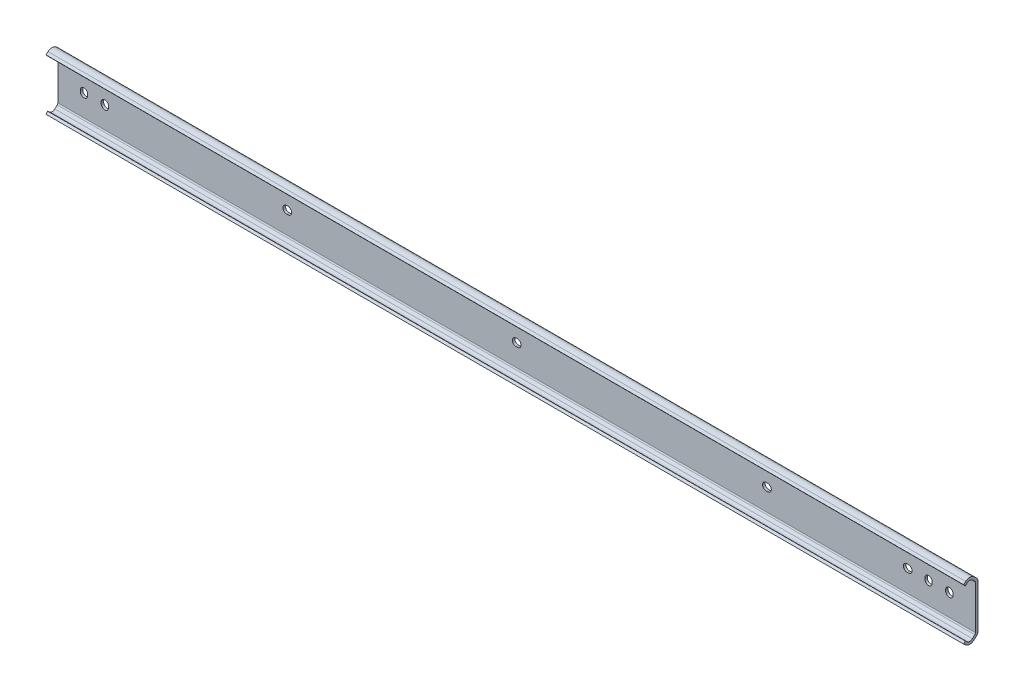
ISO-10303-21;
HEADER;
FILE_DESCRIPTION(('STEP AP214'),'2;1');
FILE_NAME('part.step','',(''),(''),'','','');
FILE_SCHEMA(('AUTOMOTIVE_DESIGN { 1 0 10303 214 1 1 1 1 }'));
ENDSEC;
DATA;
#1=APPLICATION_CONTEXT('core data for automotive mechanical design processes');
#2=APPLICATION_PROTOCOL_DEFINITION('international standard','automotive_design',2000,#1);
#3=PRODUCT_CONTEXT('',#1,'mechanical');
#4=PRODUCT('Part','Part','',(#3));
#5=PRODUCT_RELATED_PRODUCT_CATEGORY('part','',(#4));
#6=PRODUCT_DEFINITION_FORMATION('','',#4);
#7=PRODUCT_DEFINITION_CONTEXT('part definition',#1,'design');
#8=PRODUCT_DEFINITION('design','',#6,#7);
#9=PRODUCT_DEFINITION_SHAPE('','',#8);
#10=(LENGTH_UNIT() NAMED_UNIT(*) SI_UNIT(.MILLI.,.METRE.));
#11=(NAMED_UNIT(*) PLANE_ANGLE_UNIT() SI_UNIT($,.RADIAN.));
#12=(NAMED_UNIT(*) SI_UNIT($,.STERADIAN.) SOLID_ANGLE_UNIT());
#13=UNCERTAINTY_MEASURE_WITH_UNIT(LENGTH_MEASURE(1.E-05),#10,'distance_accuracy_value','');
#14=(GEOMETRIC_REPRESENTATION_CONTEXT(3) GLOBAL_UNCERTAINTY_ASSIGNED_CONTEXT((#13)) GLOBAL_UNIT_ASSIGNED_CONTEXT((#10,
#11,#12)) REPRESENTATION_CONTEXT('',''));
#15=CARTESIAN_POINT('',(0.,0.,0.));
#16=DIRECTION('',(0.,0.,1.));
#17=DIRECTION('',(1.,0.,0.));
#18=AXIS2_PLACEMENT_3D('',#15,#16,#17);
#19=CARTESIAN_POINT('',(-15.9,13.1771270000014,1.52400011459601));
#20=DIRECTION('',(0.,0.,1.));
#21=DIRECTION('',(-1.,0.,0.));
#22=AXIS2_PLACEMENT_3D('',#19,#20,#21);
#23=PLANE('',#22);
#24=DIRECTION('',(0.,-1.,0.));
#25=VECTOR('',#24,1.);
#26=CARTESIAN_POINT('',(-15.9,13.1771270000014,1.52400011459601));
#27=LINE('',#26,#25);
#28=CARTESIAN_POINT('',(-15.9,13.1771270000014,1.52400011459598));
#29=VERTEX_POINT('',#28);
#30=CARTESIAN_POINT('',(-15.9,-13.1771270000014,1.52400011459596));
#31=VERTEX_POINT('',#30);
#32=EDGE_CURVE('E742',#29,#31,#27,.T.);
#33=ORIENTED_EDGE('',*,*,#32,.T.);
#34=DIRECTION('',(-1.,0.,0.));
#35=VECTOR('',#34,1.);
#36=CARTESIAN_POINT('',(542.9,-13.1771270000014,1.52400011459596));
#37=LINE('',#36,#35);
#38=CARTESIAN_POINT('',(542.9,-13.1771270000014,1.52400011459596));
#39=VERTEX_POINT('',#38);
#40=EDGE_CURVE('E417',#39,#31,#37,.T.);
#41=ORIENTED_EDGE('',*,*,#40,.F.);
#42=DIRECTION('',(0.,-1.,0.));
#43=VECTOR('',#42,1.);
#44=CARTESIAN_POINT('',(542.9,13.1771270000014,1.52400011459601));
#45=LINE('',#44,#43);
#46=CARTESIAN_POINT('',(542.9,13.1771270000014,1.52400011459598));
#47=VERTEX_POINT('',#46);
#48=EDGE_CURVE('E712',#47,#39,#45,.T.);
#49=ORIENTED_EDGE('',*,*,#48,.F.);
#50=DIRECTION('',(1.,0.,0.));
#51=VECTOR('',#50,1.);
#52=CARTESIAN_POINT('',(-15.9,13.1771270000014,1.52400011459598));
#53=LINE('',#52,#51);
#54=EDGE_CURVE('E9',#29,#47,#53,.T.);
#55=ORIENTED_EDGE('',*,*,#54,.F.);
#56=EDGE_LOOP('',(#33,#41,#49,#55));
#57=FACE_BOUND('',#56,.T.);
#58=CARTESIAN_POINT('',(124.2,0.,1.52400011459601));
#59=DIRECTION('',(0.,0.,1.));
#60=DIRECTION('',(-1.,0.,0.));
#61=AXIS2_PLACEMENT_3D('',#58,#59,#60);
#62=CIRCLE('',#61,2.25);
#63=CARTESIAN_POINT('',(124.2,-2.25,1.52400011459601));
#64=VERTEX_POINT('',#63);
#65=CARTESIAN_POINT('',(124.2,2.25,1.52400011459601));
#66=VERTEX_POINT('',#65);
#67=EDGE_CURVE('E31',#64,#66,#62,.T.);
#68=ORIENTED_EDGE('',*,*,#67,.F.);
#69=DIRECTION('',(1.,0.,0.));
#70=VECTOR('',#69,1.);
#71=CARTESIAN_POINT('',(124.2,-2.25,1.52400011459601));
#72=LINE('',#71,#70);
#73=CARTESIAN_POINT('',(123.4,-2.25,1.52400011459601));
#74=VERTEX_POINT('',#73);
#75=EDGE_CURVE('E447',#74,#64,#72,.T.);
#76=ORIENTED_EDGE('',*,*,#75,.F.);
#77=CARTESIAN_POINT('',(123.4,0.,1.52400011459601));
#78=DIRECTION('',(0.,0.,1.));
#79=DIRECTION('',(-1.,0.,0.));
#80=AXIS2_PLACEMENT_3D('',#77,#78,#79);
#81=CIRCLE('',#80,2.25);
#82=CARTESIAN_POINT('',(123.4,2.25,1.52400011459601));
#83=VERTEX_POINT('',#82);
#84=EDGE_CURVE('E444',#83,#74,#81,.T.);
#85=ORIENTED_EDGE('',*,*,#84,.F.);
#86=DIRECTION('',(-1.,0.,0.));
#87=VECTOR('',#86,1.);
#88=CARTESIAN_POINT('',(124.2,2.25,1.52400011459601));
#89=LINE('',#88,#87);
#90=EDGE_CURVE('E442',#66,#83,#89,.T.);
#91=ORIENTED_EDGE('',*,*,#90,.F.);
#92=EDGE_LOOP('',(#68,#76,#85,#91));
#93=FACE_BOUND('',#92,.T.);
#94=CARTESIAN_POINT('',(263.9,0.,1.52400011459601));
#95=DIRECTION('',(0.,0.,1.));
#96=DIRECTION('',(-1.,0.,0.));
#97=AXIS2_PLACEMENT_3D('',#94,#95,#96);
#98=CIRCLE('',#97,2.25);
#99=CARTESIAN_POINT('',(263.9,-2.25,1.52400011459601));
#100=VERTEX_POINT('',#99);
#101=CARTESIAN_POINT('',(263.9,2.25,1.52400011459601));
#102=VERTEX_POINT('',#101);
#103=EDGE_CURVE('E469',#100,#102,#98,.T.);
#104=ORIENTED_EDGE('',*,*,#103,.F.);
#105=DIRECTION('',(1.,0.,0.));
#106=VECTOR('',#105,1.);
#107=CARTESIAN_POINT('',(263.9,-2.25,1.52400011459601));
#108=LINE('',#107,#106);
#109=CARTESIAN_POINT('',(263.1,-2.25,1.52400011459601));
#110=VERTEX_POINT('',#109);
#111=EDGE_CURVE('E477',#110,#100,#108,.T.);
#112=ORIENTED_EDGE('',*,*,#111,.F.);
#113=CARTESIAN_POINT('',(263.1,0.,1.52400011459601));
#114=DIRECTION('',(0.,0.,1.));
#115=DIRECTION('',(-1.,0.,0.));
#116=AXIS2_PLACEMENT_3D('',#113,#114,#115);
#117=CIRCLE('',#116,2.25);
#118=CARTESIAN_POINT('',(263.1,2.25,1.52400011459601));
#119=VERTEX_POINT('',#118);
#120=EDGE_CURVE('E474',#119,#110,#117,.T.);
#121=ORIENTED_EDGE('',*,*,#120,.F.);
#122=DIRECTION('',(-1.,0.,0.));
#123=VECTOR('',#122,1.);
#124=CARTESIAN_POINT('',(263.9,2.25,1.52400011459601));
#125=LINE('',#124,#123);
#126=EDGE_CURVE('E471',#102,#119,#125,.T.);
#127=ORIENTED_EDGE('',*,*,#126,.F.);
#128=EDGE_LOOP('',(#104,#112,#121,#127));
#129=FACE_BOUND('',#128,.T.);
#130=CARTESIAN_POINT('',(416.3,0.,1.52400011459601));
#131=DIRECTION('',(0.,0.,1.));
#132=DIRECTION('',(-1.,0.,0.));
#133=AXIS2_PLACEMENT_3D('',#130,#131,#132);
#134=CIRCLE('',#133,2.25);
#135=CARTESIAN_POINT('',(416.3,-2.25,1.52400011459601));
#136=VERTEX_POINT('',#135);
#137=CARTESIAN_POINT('',(416.3,2.25,1.52400011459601));
#138=VERTEX_POINT('',#137);
#139=EDGE_CURVE('E501',#136,#138,#134,.T.);
#140=ORIENTED_EDGE('',*,*,#139,.F.);
#141=DIRECTION('',(1.,0.,0.));
#142=VECTOR('',#141,1.);
#143=CARTESIAN_POINT('',(416.3,-2.25,1.52400011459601));
#144=LINE('',#143,#142);
#145=CARTESIAN_POINT('',(415.5,-2.25,1.52400011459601));
#146=VERTEX_POINT('',#145);
#147=EDGE_CURVE('E509',#146,#136,#144,.T.);
#148=ORIENTED_EDGE('',*,*,#147,.F.);
#149=CARTESIAN_POINT('',(415.5,0.,1.52400011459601));
#150=DIRECTION('',(0.,0.,1.));
#151=DIRECTION('',(-1.,0.,0.));
#152=AXIS2_PLACEMENT_3D('',#149,#150,#151);
#153=CIRCLE('',#152,2.25);
#154=CARTESIAN_POINT('',(415.5,2.25,1.52400011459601));
#155=VERTEX_POINT('',#154);
#156=EDGE_CURVE('E506',#155,#146,#153,.T.);
#157=ORIENTED_EDGE('',*,*,#156,.F.);
#158=DIRECTION('',(-1.,0.,0.));
#159=VECTOR('',#158,1.);
#160=CARTESIAN_POINT('',(416.3,2.25,1.52400011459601));
#161=LINE('',#160,#159);
#162=EDGE_CURVE('E503',#138,#155,#161,.T.);
#163=ORIENTED_EDGE('',*,*,#162,.F.);
#164=EDGE_LOOP('',(#140,#148,#157,#163));
#165=FACE_BOUND('',#164,.T.);
#166=CARTESIAN_POINT('',(0.,-0.4,1.52400011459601));
#167=DIRECTION('',(0.,0.,1.));
#168=DIRECTION('',(-1.,0.,0.));
#169=AXIS2_PLACEMENT_3D('',#166,#167,#168);
#170=CIRCLE('',#169,2.24999999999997);
#171=CARTESIAN_POINT('',(-2.24999999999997,-0.4,1.52400011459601));
#172=VERTEX_POINT('',#171);
#173=CARTESIAN_POINT('',(2.25000000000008,-0.400000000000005,1.52400011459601));
#174=VERTEX_POINT('',#173);
#175=EDGE_CURVE('E533',#172,#174,#170,.T.);
#176=ORIENTED_EDGE('',*,*,#175,.F.);
#177=DIRECTION('',(0.,-1.,0.));
#178=VECTOR('',#177,1.);
#179=CARTESIAN_POINT('',(-2.24999999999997,-0.4,1.52400011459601));
#180=LINE('',#179,#178);
#181=CARTESIAN_POINT('',(-2.24999999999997,0.4,1.52400011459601));
#182=VERTEX_POINT('',#181);
#183=EDGE_CURVE('E541',#182,#172,#180,.T.);
#184=ORIENTED_EDGE('',*,*,#183,.F.);
#185=CARTESIAN_POINT('',(0.,0.4,1.52400011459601));
#186=DIRECTION('',(0.,0.,1.));
#187=DIRECTION('',(-1.,0.,0.));
#188=AXIS2_PLACEMENT_3D('',#185,#186,#187);
#189=CIRCLE('',#188,2.24999999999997);
#190=CARTESIAN_POINT('',(2.25000000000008,0.4,1.52400011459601));
#191=VERTEX_POINT('',#190);
#192=EDGE_CURVE('E538',#191,#182,#189,.T.);
#193=ORIENTED_EDGE('',*,*,#192,.F.);
#194=DIRECTION('',(0.,1.,0.));
#195=VECTOR('',#194,1.);
#196=CARTESIAN_POINT('',(2.25000000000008,-0.4,1.52400011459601));
#197=LINE('',#196,#195);
#198=EDGE_CURVE('E535',#174,#191,#197,.T.);
#199=ORIENTED_EDGE('',*,*,#198,.F.);
#200=EDGE_LOOP('',(#176,#184,#193,#199));
#201=FACE_BOUND('',#200,.T.);
#202=CARTESIAN_POINT('',(12.7,-0.4,1.52400011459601));
#203=DIRECTION('',(0.,0.,1.));
#204=DIRECTION('',(-1.,0.,0.));
#205=AXIS2_PLACEMENT_3D('',#202,#203,#204);
#206=CIRCLE('',#205,2.24999999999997);
#207=CARTESIAN_POINT('',(10.45,-0.4,1.52400011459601));
#208=VERTEX_POINT('',#207);
#209=CARTESIAN_POINT('',(14.95,-0.400000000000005,1.52400011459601));
#210=VERTEX_POINT('',#209);
#211=EDGE_CURVE('E565',#208,#210,#206,.T.);
#212=ORIENTED_EDGE('',*,*,#211,.F.);
#213=DIRECTION('',(0.,-1.,0.));
#214=VECTOR('',#213,1.);
#215=CARTESIAN_POINT('',(10.45,-0.4,1.52400011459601));
#216=LINE('',#215,#214);
#217=CARTESIAN_POINT('',(10.45,0.4,1.52400011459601));
#218=VERTEX_POINT('',#217);
#219=EDGE_CURVE('E573',#218,#208,#216,.T.);
#220=ORIENTED_EDGE('',*,*,#219,.F.);
#221=CARTESIAN_POINT('',(12.7,0.4,1.52400011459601));
#222=DIRECTION('',(0.,0.,1.));
#223=DIRECTION('',(-1.,0.,0.));
#224=AXIS2_PLACEMENT_3D('',#221,#222,#223);
#225=CIRCLE('',#224,2.24999999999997);
#226=CARTESIAN_POINT('',(14.95,0.4,1.52400011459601));
#227=VERTEX_POINT('',#226);
#228=EDGE_CURVE('E570',#227,#218,#225,.T.);
#229=ORIENTED_EDGE('',*,*,#228,.F.);
#230=DIRECTION('',(0.,1.,0.));
#231=VECTOR('',#230,1.);
#232=CARTESIAN_POINT('',(14.95,-0.4,1.52400011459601));
#233=LINE('',#232,#231);
#234=EDGE_CURVE('E567',#210,#227,#233,.T.);
#235=ORIENTED_EDGE('',*,*,#234,.F.);
#236=EDGE_LOOP('',(#212,#220,#229,#235));
#237=FACE_BOUND('',#236,.T.);
#238=CARTESIAN_POINT('',(514.3,-0.4,1.52400011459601));
#239=DIRECTION('',(0.,0.,1.));
#240=DIRECTION('',(-1.,0.,0.));
#241=AXIS2_PLACEMENT_3D('',#238,#239,#240);
#242=CIRCLE('',#241,2.25);
#243=CARTESIAN_POINT('',(512.05,-0.4,1.52400011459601));
#244=VERTEX_POINT('',#243);
#245=CARTESIAN_POINT('',(516.55,-0.400000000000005,1.52400011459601));
#246=VERTEX_POINT('',#245);
#247=EDGE_CURVE('E597',#244,#246,#242,.T.);
#248=ORIENTED_EDGE('',*,*,#247,.F.);
#249=DIRECTION('',(0.,-1.,0.));
#250=VECTOR('',#249,1.);
#251=CARTESIAN_POINT('',(512.05,-0.4,1.52400011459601));
#252=LINE('',#251,#250);
#253=CARTESIAN_POINT('',(512.05,0.4,1.52400011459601));
#254=VERTEX_POINT('',#253);
#255=EDGE_CURVE('E605',#254,#244,#252,.T.);
#256=ORIENTED_EDGE('',*,*,#255,.F.);
#257=CARTESIAN_POINT('',(514.3,0.4,1.52400011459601));
#258=DIRECTION('',(0.,0.,1.));
#259=DIRECTION('',(-1.,0.,0.));
#260=AXIS2_PLACEMENT_3D('',#257,#258,#259);
#261=CIRCLE('',#260,2.25);
#262=CARTESIAN_POINT('',(516.55,0.4,1.52400011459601));
#263=VERTEX_POINT('',#262);
#264=EDGE_CURVE('E602',#263,#254,#261,.T.);
#265=ORIENTED_EDGE('',*,*,#264,.F.);
#266=DIRECTION('',(0.,1.,0.));
#267=VECTOR('',#266,1.);
#268=CARTESIAN_POINT('',(516.55,-0.4,1.52400011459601));
#269=LINE('',#268,#267);
#270=EDGE_CURVE('E599',#246,#263,#269,.T.);
#271=ORIENTED_EDGE('',*,*,#270,.F.);
#272=EDGE_LOOP('',(#248,#256,#265,#271));
#273=FACE_BOUND('',#272,.T.);
#274=CARTESIAN_POINT('',(502.,0.,1.52400011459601));
#275=DIRECTION('',(0.,0.,1.));
#276=DIRECTION('',(-1.,0.,0.));
#277=AXIS2_PLACEMENT_3D('',#274,#275,#276);
#278=CIRCLE('',#277,2.25);
#279=CARTESIAN_POINT('',(502.,-2.25,1.52400011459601));
#280=VERTEX_POINT('',#279);
#281=CARTESIAN_POINT('',(502.,2.25,1.52400011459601));
#282=VERTEX_POINT('',#281);
#283=EDGE_CURVE('E629',#280,#282,#278,.T.);
#284=ORIENTED_EDGE('',*,*,#283,.F.);
#285=DIRECTION('',(1.,0.,0.));
#286=VECTOR('',#285,1.);
#287=CARTESIAN_POINT('',(502.,-2.25,1.52400011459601));
#288=LINE('',#287,#286);
#289=CARTESIAN_POINT('',(501.2,-2.25,1.52400011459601));
#290=VERTEX_POINT('',#289);
#291=EDGE_CURVE('E637',#290,#280,#288,.T.);
#292=ORIENTED_EDGE('',*,*,#291,.F.);
#293=CARTESIAN_POINT('',(501.2,0.,1.52400011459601));
#294=DIRECTION('',(0.,0.,1.));
#295=DIRECTION('',(-1.,0.,0.));
#296=AXIS2_PLACEMENT_3D('',#293,#294,#295);
#297=CIRCLE('',#296,2.25);
#298=CARTESIAN_POINT('',(501.2,2.25,1.52400011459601));
#299=VERTEX_POINT('',#298);
#300=EDGE_CURVE('E634',#299,#290,#297,.T.);
#301=ORIENTED_EDGE('',*,*,#300,.F.);
#302=DIRECTION('',(-1.,0.,0.));
#303=VECTOR('',#302,1.);
#304=CARTESIAN_POINT('',(502.,2.25,1.52400011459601));
#305=LINE('',#304,#303);
#306=EDGE_CURVE('E631',#282,#299,#305,.T.);
#307=ORIENTED_EDGE('',*,*,#306,.F.);
#308=EDGE_LOOP('',(#284,#292,#301,#307));
#309=FACE_BOUND('',#308,.T.);
#310=CARTESIAN_POINT('',(527.,-0.4,1.52400011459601));
#311=DIRECTION('',(0.,0.,1.));
#312=DIRECTION('',(-1.,0.,0.));
#313=AXIS2_PLACEMENT_3D('',#310,#311,#312);
#314=CIRCLE('',#313,2.25);
#315=CARTESIAN_POINT('',(524.75,-0.4,1.52400011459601));
#316=VERTEX_POINT('',#315);
#317=CARTESIAN_POINT('',(529.25,-0.400000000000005,1.52400011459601));
#318=VERTEX_POINT('',#317);
#319=EDGE_CURVE('E661',#316,#318,#314,.T.);
#320=ORIENTED_EDGE('',*,*,#319,.F.);
#321=DIRECTION('',(0.,-1.,0.));
#322=VECTOR('',#321,1.);
#323=CARTESIAN_POINT('',(524.75,-0.4,1.52400011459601));
#324=LINE('',#323,#322);
#325=CARTESIAN_POINT('',(524.75,0.4,1.52400011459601));
#326=VERTEX_POINT('',#325);
#327=EDGE_CURVE('E669',#326,#316,#324,.T.);
#328=ORIENTED_EDGE('',*,*,#327,.F.);
#329=CARTESIAN_POINT('',(527.,0.4,1.52400011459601));
#330=DIRECTION('',(0.,0.,1.));
#331=DIRECTION('',(-1.,0.,0.));
#332=AXIS2_PLACEMENT_3D('',#329,#330,#331);
#333=CIRCLE('',#332,2.25);
#334=CARTESIAN_POINT('',(529.25,0.4,1.52400011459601));
#335=VERTEX_POINT('',#334);
#336=EDGE_CURVE('E666',#335,#326,#333,.T.);
#337=ORIENTED_EDGE('',*,*,#336,.F.);
#338=DIRECTION('',(0.,1.,0.));
#339=VECTOR('',#338,1.);
#340=CARTESIAN_POINT('',(529.25,-0.4,1.52400011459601));
#341=LINE('',#340,#339);
#342=EDGE_CURVE('E663',#318,#335,#341,.T.);
#343=ORIENTED_EDGE('',*,*,#342,.F.);
#344=EDGE_LOOP('',(#320,#328,#337,#343));
#345=FACE_BOUND('',#344,.T.);
#346=ADVANCED_FACE('F14',(#57,#93,#129,#165,#201,#237,#273,#309,#345),#23,.T.);
#347=CARTESIAN_POINT('',(-15.9,13.1771270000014,2.82399974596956));
#348=DIRECTION('',(1.,0.,0.));
#349=DIRECTION('',(0.,0.,1.));
#350=AXIS2_PLACEMENT_3D('',#347,#348,#349);
#351=CYLINDRICAL_SURFACE('',#350,1.29999963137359);
#352=CARTESIAN_POINT('',(542.9,13.1771270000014,2.82399974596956));
#353=DIRECTION('',(-1.,0.,0.));
#354=DIRECTION('',(0.,0.,-1.));
#355=AXIS2_PLACEMENT_3D('',#352,#353,#354);
#356=CIRCLE('',#355,1.29999963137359);
#357=CARTESIAN_POINT('',(542.9,14.1308812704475,1.94062449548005));
#358=VERTEX_POINT('',#357);
#359=EDGE_CURVE('E709',#358,#47,#356,.T.);
#360=ORIENTED_EDGE('',*,*,#359,.F.);
#361=DIRECTION('',(1.,0.,0.));
#362=VECTOR('',#361,1.);
#363=CARTESIAN_POINT('',(-15.9,14.1308812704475,1.94062449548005));
#364=LINE('',#363,#362);
#365=CARTESIAN_POINT('',(-15.9,14.1308812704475,1.94062449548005));
#366=VERTEX_POINT('',#365);
#367=EDGE_CURVE('E23',#366,#358,#364,.T.);
#368=ORIENTED_EDGE('',*,*,#367,.F.);
#369=CARTESIAN_POINT('',(-15.9,13.1771270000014,2.82399974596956));
#370=DIRECTION('',(-1.,0.,0.));
#371=DIRECTION('',(0.,0.,-1.));
#372=AXIS2_PLACEMENT_3D('',#369,#370,#371);
#373=CIRCLE('',#372,1.29999963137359);
#374=EDGE_CURVE('E739',#366,#29,#373,.T.);
#375=ORIENTED_EDGE('',*,*,#374,.T.);
#376=ORIENTED_EDGE('',*,*,#54,.T.);
#377=EDGE_LOOP('',(#360,#368,#375,#376));
#378=FACE_BOUND('',#377,.T.);
#379=ADVANCED_FACE('F798',(#378),#351,.F.);
#380=CARTESIAN_POINT('',(-15.9,15.4973237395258,3.41593142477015));
#381=DIRECTION('',(0.,-0.733657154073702,0.679519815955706));
#382=DIRECTION('',(0.,-0.679519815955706,-0.733657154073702));
#383=AXIS2_PLACEMENT_3D('',#380,#381,#382);
#384=PLANE('',#383);
#385=DIRECTION('',(0.,-0.679519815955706,-0.733657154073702));
#386=VECTOR('',#385,1.);
#387=CARTESIAN_POINT('',(542.9,15.4973237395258,3.41593142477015));
#388=LINE('',#387,#386);
#389=CARTESIAN_POINT('',(542.9,15.4973237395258,3.41593142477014));
#390=VERTEX_POINT('',#389);
#391=EDGE_CURVE('E706',#390,#358,#388,.T.);
#392=ORIENTED_EDGE('',*,*,#391,.F.);
#393=DIRECTION('',(1.,0.,0.));
#394=VECTOR('',#393,1.);
#395=CARTESIAN_POINT('',(-15.9,15.4973237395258,3.41593142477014));
#396=LINE('',#395,#394);
#397=CARTESIAN_POINT('',(-15.9,15.4973237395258,3.41593142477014));
#398=VERTEX_POINT('',#397);
#399=EDGE_CURVE('E745',#398,#390,#396,.T.);
#400=ORIENTED_EDGE('',*,*,#399,.F.);
#401=DIRECTION('',(0.,-0.679519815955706,-0.733657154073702));
#402=VECTOR('',#401,1.);
#403=CARTESIAN_POINT('',(-15.9,15.4973237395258,3.41593142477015));
#404=LINE('',#403,#402);
#405=EDGE_CURVE('E736',#398,#366,#404,.T.);
#406=ORIENTED_EDGE('',*,*,#405,.T.);
#407=ORIENTED_EDGE('',*,*,#367,.T.);
#408=EDGE_LOOP('',(#392,#400,#406,#407));
#409=FACE_BOUND('',#408,.T.);
#410=ADVANCED_FACE('F794',(#409),#384,.T.);
#411=CARTESIAN_POINT('',(-15.9,13.745000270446,5.04999949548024));
#412=DIRECTION('',(1.,0.,0.));
#413=DIRECTION('',(0.,0.,1.));
#414=AXIS2_PLACEMENT_3D('',#411,#412,#413);
#415=CYLINDRICAL_SURFACE('',#414,2.39600000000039);
#416=CARTESIAN_POINT('',(542.9,13.745000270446,5.04999949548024));
#417=DIRECTION('',(-1.,0.,0.));
#418=DIRECTION('',(0.,0.,-1.));
#419=AXIS2_PLACEMENT_3D('',#416,#417,#418);
#420=CIRCLE('',#419,2.39600000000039);
#421=CARTESIAN_POINT('',(542.9,15.4018251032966,6.78082226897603));
#422=VERTEX_POINT('',#421);
#423=EDGE_CURVE('E703',#422,#390,#420,.T.);
#424=ORIENTED_EDGE('',*,*,#423,.F.);
#425=DIRECTION('',(1.,0.,0.));
#426=VECTOR('',#425,1.);
#427=CARTESIAN_POINT('',(-15.9,15.4018251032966,6.78082226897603));
#428=LINE('',#427,#426);
#429=CARTESIAN_POINT('',(-15.9,15.4018251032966,6.78082226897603));
#430=VERTEX_POINT('',#429);
#431=EDGE_CURVE('E747',#430,#422,#428,.T.);
#432=ORIENTED_EDGE('',*,*,#431,.F.);
#433=CARTESIAN_POINT('',(-15.9,13.745000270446,5.04999949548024));
#434=DIRECTION('',(-1.,0.,0.));
#435=DIRECTION('',(0.,0.,-1.));
#436=AXIS2_PLACEMENT_3D('',#433,#434,#435);
#437=CIRCLE('',#436,2.39600000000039);
#438=EDGE_CURVE('E733',#430,#398,#437,.T.);
#439=ORIENTED_EDGE('',*,*,#438,.T.);
#440=ORIENTED_EDGE('',*,*,#399,.T.);
#441=EDGE_LOOP('',(#424,#432,#439,#440));
#442=FACE_BOUND('',#441,.T.);
#443=ADVANCED_FACE('F790',(#442),#415,.F.);
#444=CARTESIAN_POINT('',(-15.9,15.4018251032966,6.78082226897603));
#445=DIRECTION('',(0.,-0.741021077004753,-0.671481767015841));
#446=DIRECTION('',(0.,0.671481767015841,-0.741021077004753));
#447=AXIS2_PLACEMENT_3D('',#444,#445,#446);
#448=PLANE('',#447);
#449=DIRECTION('',(0.,0.671481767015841,-0.741021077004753));
#450=VECTOR('',#449,1.);
#451=CARTESIAN_POINT('',(542.9,15.4018251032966,6.78082226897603));
#452=LINE('',#451,#450);
#453=CARTESIAN_POINT('',(542.9,14.5356842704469,7.73666149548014));
#454=VERTEX_POINT('',#453);
#455=EDGE_CURVE('E700',#454,#422,#452,.T.);
#456=ORIENTED_EDGE('',*,*,#455,.F.);
#457=DIRECTION('',(1.,0.,0.));
#458=VECTOR('',#457,1.);
#459=CARTESIAN_POINT('',(-15.9,14.5356842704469,7.73666149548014));
#460=LINE('',#459,#458);
#461=CARTESIAN_POINT('',(-15.9,14.5356842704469,7.73666149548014));
#462=VERTEX_POINT('',#461);
#463=EDGE_CURVE('E749',#462,#454,#460,.T.);
#464=ORIENTED_EDGE('',*,*,#463,.F.);
#465=DIRECTION('',(0.,0.671481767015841,-0.741021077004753));
#466=VECTOR('',#465,1.);
#467=CARTESIAN_POINT('',(-15.9,15.4018251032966,6.78082226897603));
#468=LINE('',#467,#466);
#469=EDGE_CURVE('E730',#462,#430,#468,.T.);
#470=ORIENTED_EDGE('',*,*,#469,.T.);
#471=ORIENTED_EDGE('',*,*,#431,.T.);
#472=EDGE_LOOP('',(#456,#464,#470,#471));
#473=FACE_BOUND('',#472,.T.);
#474=ADVANCED_FACE('F786',(#473),#448,.T.);
#475=CARTESIAN_POINT('',(-15.9,14.5356842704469,7.73666149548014));
#476=DIRECTION('',(0.,-0.671481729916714,0.741021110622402));
#477=DIRECTION('',(0.,-0.741021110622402,-0.671481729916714));
#478=AXIS2_PLACEMENT_3D('',#475,#476,#477);
#479=PLANE('',#478);
#480=DIRECTION('',(0.,-0.741021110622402,-0.671481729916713));
#481=VECTOR('',#480,1.);
#482=CARTESIAN_POINT('',(542.9,14.5356842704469,7.73666149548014));
#483=LINE('',#482,#481);
#484=CARTESIAN_POINT('',(542.9,15.6649899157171,8.75999011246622));
#485=VERTEX_POINT('',#484);
#486=EDGE_CURVE('E697',#485,#454,#483,.T.);
#487=ORIENTED_EDGE('',*,*,#486,.F.);
#488=DIRECTION('',(1.,0.,0.));
#489=VECTOR('',#488,1.);
#490=CARTESIAN_POINT('',(-15.9,15.6649899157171,8.75999011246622));
#491=LINE('',#490,#489);
#492=CARTESIAN_POINT('',(-15.9,15.6649899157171,8.75999011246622));
#493=VERTEX_POINT('',#492);
#494=EDGE_CURVE('E751',#493,#485,#491,.T.);
#495=ORIENTED_EDGE('',*,*,#494,.F.);
#496=DIRECTION('',(0.,-0.741021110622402,-0.671481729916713));
#497=VECTOR('',#496,1.);
#498=CARTESIAN_POINT('',(-15.9,14.5356842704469,7.73666149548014));
#499=LINE('',#498,#497);
#500=EDGE_CURVE('E727',#493,#462,#499,.T.);
#501=ORIENTED_EDGE('',*,*,#500,.T.);
#502=ORIENTED_EDGE('',*,*,#463,.T.);
#503=EDGE_LOOP('',(#487,#495,#501,#502));
#504=FACE_BOUND('',#503,.T.);
#505=ADVANCED_FACE('F782',(#504),#479,.T.);
#506=CARTESIAN_POINT('',(-15.9,16.7914015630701,7.51692662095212));
#507=DIRECTION('',(0.,0.741020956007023,0.671481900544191));
#508=DIRECTION('',(0.,-0.671481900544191,0.741020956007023));
#509=AXIS2_PLACEMENT_3D('',#506,#507,#508);
#510=PLANE('',#509);
#511=DIRECTION('',(0.,-0.671481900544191,0.741020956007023));
#512=VECTOR('',#511,1.);
#513=CARTESIAN_POINT('',(542.9,16.7914015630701,7.51692662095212));
#514=LINE('',#513,#512);
#515=CARTESIAN_POINT('',(542.9,16.7914015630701,7.5169266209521));
#516=VERTEX_POINT('',#515);
#517=EDGE_CURVE('E694',#516,#485,#514,.T.);
#518=ORIENTED_EDGE('',*,*,#517,.F.);
#519=DIRECTION('',(1.,0.,0.));
#520=VECTOR('',#519,1.);
#521=CARTESIAN_POINT('',(-15.9,16.7914015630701,7.5169266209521));
#522=LINE('',#521,#520);
#523=CARTESIAN_POINT('',(-15.9,16.7914015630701,7.5169266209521));
#524=VERTEX_POINT('',#523);
#525=EDGE_CURVE('E753',#524,#516,#522,.T.);
#526=ORIENTED_EDGE('',*,*,#525,.F.);
#527=DIRECTION('',(0.,-0.671481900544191,0.741020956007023));
#528=VECTOR('',#527,1.);
#529=CARTESIAN_POINT('',(-15.9,16.7914015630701,7.51692662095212));
#530=LINE('',#529,#528);
#531=EDGE_CURVE('E724',#524,#493,#530,.T.);
#532=ORIENTED_EDGE('',*,*,#531,.T.);
#533=ORIENTED_EDGE('',*,*,#494,.T.);
#534=EDGE_LOOP('',(#518,#526,#532,#533));
#535=FACE_BOUND('',#534,.T.);
#536=ADVANCED_FACE('F778',(#535),#510,.T.);
#537=CARTESIAN_POINT('',(-15.9,13.745000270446,5.04999949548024));
#538=DIRECTION('',(1.,0.,0.));
#539=DIRECTION('',(0.,0.,1.));
#540=AXIS2_PLACEMENT_3D('',#537,#538,#539);
#541=CYLINDRICAL_SURFACE('',#540,3.91998600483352);
#542=CARTESIAN_POINT('',(542.9,13.745000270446,5.04999949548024));
#543=DIRECTION('',(1.,0.,0.));
#544=DIRECTION('',(0.,0.,-1.));
#545=AXIS2_PLACEMENT_3D('',#542,#543,#544);
#546=CIRCLE('',#545,3.91998600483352);
#547=CARTESIAN_POINT('',(542.9,16.620926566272,2.38629188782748));
#548=VERTEX_POINT('',#547);
#549=EDGE_CURVE('E691',#548,#516,#546,.T.);
#550=ORIENTED_EDGE('',*,*,#549,.F.);
#551=DIRECTION('',(1.,0.,0.));
#552=VECTOR('',#551,1.);
#553=CARTESIAN_POINT('',(-15.9,16.620926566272,2.38629188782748));
#554=LINE('',#553,#552);
#555=CARTESIAN_POINT('',(-15.9,16.620926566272,2.38629188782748));
#556=VERTEX_POINT('',#555);
#557=EDGE_CURVE('E755',#556,#548,#554,.T.);
#558=ORIENTED_EDGE('',*,*,#557,.F.);
#559=CARTESIAN_POINT('',(-15.9,13.745000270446,5.04999949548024));
#560=DIRECTION('',(1.,0.,0.));
#561=DIRECTION('',(0.,0.,-1.));
#562=AXIS2_PLACEMENT_3D('',#559,#560,#561);
#563=CIRCLE('',#562,3.91998600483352);
#564=EDGE_CURVE('E721',#556,#524,#563,.T.);
#565=ORIENTED_EDGE('',*,*,#564,.T.);
#566=ORIENTED_EDGE('',*,*,#525,.T.);
#567=EDGE_LOOP('',(#550,#558,#565,#566));
#568=FACE_BOUND('',#567,.T.);
#569=ADVANCED_FACE('F774',(#568),#541,.T.);
#570=CARTESIAN_POINT('',(-15.9,16.620926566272,2.38629188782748));
#571=DIRECTION('',(0.,0.73365728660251,-0.679519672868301));
#572=DIRECTION('',(0.,0.679519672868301,0.73365728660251));
#573=AXIS2_PLACEMENT_3D('',#570,#571,#572);
#574=PLANE('',#573);
#575=DIRECTION('',(0.,0.679519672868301,0.73365728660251));
#576=VECTOR('',#575,1.);
#577=CARTESIAN_POINT('',(542.9,16.620926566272,2.38629188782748));
#578=LINE('',#577,#576);
#579=CARTESIAN_POINT('',(542.9,15.2489749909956,0.90503636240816));
#580=VERTEX_POINT('',#579);
#581=EDGE_CURVE('E689',#580,#548,#578,.T.);
#582=ORIENTED_EDGE('',*,*,#581,.F.);
#583=DIRECTION('',(1.,0.,0.));
#584=VECTOR('',#583,1.);
#585=CARTESIAN_POINT('',(-15.9,15.2489749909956,0.90503636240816));
#586=LINE('',#585,#584);
#587=CARTESIAN_POINT('',(-15.9,15.2489749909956,0.90503636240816));
#588=VERTEX_POINT('',#587);
#589=EDGE_CURVE('E757',#588,#580,#586,.T.);
#590=ORIENTED_EDGE('',*,*,#589,.F.);
#591=DIRECTION('',(0.,0.679519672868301,0.73365728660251));
#592=VECTOR('',#591,1.);
#593=CARTESIAN_POINT('',(-15.9,16.620926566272,2.38629188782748));
#594=LINE('',#593,#592);
#595=EDGE_CURVE('E719',#588,#556,#594,.T.);
#596=ORIENTED_EDGE('',*,*,#595,.T.);
#597=ORIENTED_EDGE('',*,*,#557,.T.);
#598=EDGE_LOOP('',(#582,#590,#596,#597));
#599=FACE_BOUND('',#598,.T.);
#600=ADVANCED_FACE('F770',(#599),#574,.T.);
#601=CARTESIAN_POINT('',(-15.9,13.1771270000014,2.82399974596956));
#602=DIRECTION('',(1.,0.,0.));
#603=DIRECTION('',(0.,0.,1.));
#604=AXIS2_PLACEMENT_3D('',#601,#602,#603);
#605=CYLINDRICAL_SURFACE('',#604,2.82399974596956);
#606=CARTESIAN_POINT('',(542.9,13.1771270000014,2.82399974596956));
#607=DIRECTION('',(1.,0.,0.));
#608=DIRECTION('',(0.,0.,-1.));
#609=AXIS2_PLACEMENT_3D('',#606,#607,#608);
#610=CIRCLE('',#609,2.82399974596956);
#611=CARTESIAN_POINT('',(542.9,13.1771270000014,0.));
#612=VERTEX_POINT('',#611);
#613=EDGE_CURVE('E686',#612,#580,#610,.T.);
#614=ORIENTED_EDGE('',*,*,#613,.F.);
#615=DIRECTION('',(1.,0.,0.));
#616=VECTOR('',#615,1.);
#617=CARTESIAN_POINT('',(-15.9,13.1771270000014,0.));
#618=LINE('',#617,#616);
#619=CARTESIAN_POINT('',(-15.9,13.1771270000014,0.));
#620=VERTEX_POINT('',#619);
#621=EDGE_CURVE('E18',#620,#612,#618,.T.);
#622=ORIENTED_EDGE('',*,*,#621,.F.);
#623=CARTESIAN_POINT('',(-15.9,13.1771270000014,2.82399974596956));
#624=DIRECTION('',(1.,0.,0.));
#625=DIRECTION('',(0.,0.,-1.));
#626=AXIS2_PLACEMENT_3D('',#623,#624,#625);
#627=CIRCLE('',#626,2.82399974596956);
#628=EDGE_CURVE('E716',#620,#588,#627,.T.);
#629=ORIENTED_EDGE('',*,*,#628,.T.);
#630=ORIENTED_EDGE('',*,*,#589,.T.);
#631=EDGE_LOOP('',(#614,#622,#629,#630));
#632=FACE_BOUND('',#631,.T.);
#633=ADVANCED_FACE('F766',(#632),#605,.T.);
#634=CARTESIAN_POINT('',(-15.9,13.1771270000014,0.));
#635=DIRECTION('',(0.,0.,-1.));
#636=DIRECTION('',(1.,0.,0.));
#637=AXIS2_PLACEMENT_3D('',#634,#635,#636);
#638=PLANE('',#637);
#639=ORIENTED_EDGE('',*,*,#621,.T.);
#640=DIRECTION('',(0.,1.,0.));
#641=VECTOR('',#640,1.);
#642=CARTESIAN_POINT('',(542.9,13.1771270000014,0.));
#643=LINE('',#642,#641);
#644=CARTESIAN_POINT('',(542.9,-13.1771270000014,0.));
#645=VERTEX_POINT('',#644);
#646=EDGE_CURVE('E684',#645,#612,#643,.T.);
#647=ORIENTED_EDGE('',*,*,#646,.F.);
#648=DIRECTION('',(-1.,0.,0.));
#649=VECTOR('',#648,1.);
#650=CARTESIAN_POINT('',(542.9,-13.1771270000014,0.));
#651=LINE('',#650,#649);
#652=CARTESIAN_POINT('',(-15.9,-13.1771270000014,0.));
#653=VERTEX_POINT('',#652);
#654=EDGE_CURVE('E370',#645,#653,#651,.T.);
#655=ORIENTED_EDGE('',*,*,#654,.T.);
#656=DIRECTION('',(0.,1.,0.));
#657=VECTOR('',#656,1.);
#658=CARTESIAN_POINT('',(-15.9,13.1771270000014,0.));
#659=LINE('',#658,#657);
#660=EDGE_CURVE('E714',#653,#620,#659,.T.);
#661=ORIENTED_EDGE('',*,*,#660,.T.);
#662=EDGE_LOOP('',(#639,#647,#655,#661));
#663=FACE_BOUND('',#662,.T.);
#664=CARTESIAN_POINT('',(124.2,0.,0.));
#665=DIRECTION('',(0.,0.,-1.));
#666=DIRECTION('',(1.,0.,0.));
#667=AXIS2_PLACEMENT_3D('',#664,#665,#666);
#668=CIRCLE('',#667,2.25);
#669=CARTESIAN_POINT('',(124.2,-2.25,0.));
#670=VERTEX_POINT('',#669);
#671=CARTESIAN_POINT('',(124.2,2.25,0.));
#672=VERTEX_POINT('',#671);
#673=EDGE_CURVE('E438',#670,#672,#668,.F.);
#674=ORIENTED_EDGE('',*,*,#673,.T.);
#675=DIRECTION('',(-1.,0.,0.));
#676=VECTOR('',#675,1.);
#677=CARTESIAN_POINT('',(124.2,2.25,0.));
#678=LINE('',#677,#676);
#679=CARTESIAN_POINT('',(123.4,2.25,0.));
#680=VERTEX_POINT('',#679);
#681=EDGE_CURVE('E453',#672,#680,#678,.T.);
#682=ORIENTED_EDGE('',*,*,#681,.T.);
#683=CARTESIAN_POINT('',(123.4,0.,0.));
#684=DIRECTION('',(0.,0.,-1.));
#685=DIRECTION('',(1.,0.,0.));
#686=AXIS2_PLACEMENT_3D('',#683,#684,#685);
#687=CIRCLE('',#686,2.25);
#688=CARTESIAN_POINT('',(123.4,-2.25,0.));
#689=VERTEX_POINT('',#688);
#690=EDGE_CURVE('E416',#680,#689,#687,.F.);
#691=ORIENTED_EDGE('',*,*,#690,.T.);
#692=DIRECTION('',(1.,0.,0.));
#693=VECTOR('',#692,1.);
#694=CARTESIAN_POINT('',(124.2,-2.25,0.));
#695=LINE('',#694,#693);
#696=EDGE_CURVE('E435',#689,#670,#695,.T.);
#697=ORIENTED_EDGE('',*,*,#696,.T.);
#698=EDGE_LOOP('',(#674,#682,#691,#697));
#699=FACE_BOUND('',#698,.T.);
#700=CARTESIAN_POINT('',(263.9,0.,0.));
#701=DIRECTION('',(0.,0.,-1.));
#702=DIRECTION('',(1.,0.,0.));
#703=AXIS2_PLACEMENT_3D('',#700,#701,#702);
#704=CIRCLE('',#703,2.25);
#705=CARTESIAN_POINT('',(263.9,-2.25,0.));
#706=VERTEX_POINT('',#705);
#707=CARTESIAN_POINT('',(263.9,2.25,0.));
#708=VERTEX_POINT('',#707);
#709=EDGE_CURVE('E466',#706,#708,#704,.F.);
#710=ORIENTED_EDGE('',*,*,#709,.T.);
#711=DIRECTION('',(-1.,0.,0.));
#712=VECTOR('',#711,1.);
#713=CARTESIAN_POINT('',(263.9,2.25,0.));
#714=LINE('',#713,#712);
#715=CARTESIAN_POINT('',(263.1,2.25,0.));
#716=VERTEX_POINT('',#715);
#717=EDGE_CURVE('E483',#708,#716,#714,.T.);
#718=ORIENTED_EDGE('',*,*,#717,.T.);
#719=CARTESIAN_POINT('',(263.1,0.,0.));
#720=DIRECTION('',(0.,0.,-1.));
#721=DIRECTION('',(1.,0.,0.));
#722=AXIS2_PLACEMENT_3D('',#719,#720,#721);
#723=CIRCLE('',#722,2.25);
#724=CARTESIAN_POINT('',(263.1,-2.25,0.));
#725=VERTEX_POINT('',#724);
#726=EDGE_CURVE('E460',#716,#725,#723,.F.);
#727=ORIENTED_EDGE('',*,*,#726,.T.);
#728=DIRECTION('',(1.,0.,0.));
#729=VECTOR('',#728,1.);
#730=CARTESIAN_POINT('',(263.9,-2.25,0.));
#731=LINE('',#730,#729);
#732=EDGE_CURVE('E463',#725,#706,#731,.T.);
#733=ORIENTED_EDGE('',*,*,#732,.T.);
#734=EDGE_LOOP('',(#710,#718,#727,#733));
#735=FACE_BOUND('',#734,.T.);
#736=CARTESIAN_POINT('',(416.3,0.,0.));
#737=DIRECTION('',(0.,0.,-1.));
#738=DIRECTION('',(1.,0.,0.));
#739=AXIS2_PLACEMENT_3D('',#736,#737,#738);
#740=CIRCLE('',#739,2.25);
#741=CARTESIAN_POINT('',(416.3,-2.25,0.));
#742=VERTEX_POINT('',#741);
#743=CARTESIAN_POINT('',(416.3,2.25,0.));
#744=VERTEX_POINT('',#743);
#745=EDGE_CURVE('E498',#742,#744,#740,.F.);
#746=ORIENTED_EDGE('',*,*,#745,.T.);
#747=DIRECTION('',(-1.,0.,0.));
#748=VECTOR('',#747,1.);
#749=CARTESIAN_POINT('',(416.3,2.25,0.));
#750=LINE('',#749,#748);
#751=CARTESIAN_POINT('',(415.5,2.25,0.));
#752=VERTEX_POINT('',#751);
#753=EDGE_CURVE('E515',#744,#752,#750,.T.);
#754=ORIENTED_EDGE('',*,*,#753,.T.);
#755=CARTESIAN_POINT('',(415.5,0.,0.));
#756=DIRECTION('',(0.,0.,-1.));
#757=DIRECTION('',(1.,0.,0.));
#758=AXIS2_PLACEMENT_3D('',#755,#756,#757);
#759=CIRCLE('',#758,2.25);
#760=CARTESIAN_POINT('',(415.5,-2.25,0.));
#761=VERTEX_POINT('',#760);
#762=EDGE_CURVE('E492',#752,#761,#759,.F.);
#763=ORIENTED_EDGE('',*,*,#762,.T.);
#764=DIRECTION('',(1.,0.,0.));
#765=VECTOR('',#764,1.);
#766=CARTESIAN_POINT('',(416.3,-2.25,0.));
#767=LINE('',#766,#765);
#768=EDGE_CURVE('E495',#761,#742,#767,.T.);
#769=ORIENTED_EDGE('',*,*,#768,.T.);
#770=EDGE_LOOP('',(#746,#754,#763,#769));
#771=FACE_BOUND('',#770,.T.);
#772=CARTESIAN_POINT('',(0.,-0.4,0.));
#773=DIRECTION('',(0.,0.,-1.));
#774=DIRECTION('',(1.,0.,0.));
#775=AXIS2_PLACEMENT_3D('',#772,#773,#774);
#776=CIRCLE('',#775,2.24999999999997);
#777=CARTESIAN_POINT('',(-2.24999999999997,-0.4,0.));
#778=VERTEX_POINT('',#777);
#779=CARTESIAN_POINT('',(2.25000000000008,-0.4,0.));
#780=VERTEX_POINT('',#779);
#781=EDGE_CURVE('E530',#778,#780,#776,.F.);
#782=ORIENTED_EDGE('',*,*,#781,.T.);
#783=DIRECTION('',(0.,1.,0.));
#784=VECTOR('',#783,1.);
#785=CARTESIAN_POINT('',(2.25000000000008,-0.4,0.));
#786=LINE('',#785,#784);
#787=CARTESIAN_POINT('',(2.25000000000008,0.4,0.));
#788=VERTEX_POINT('',#787);
#789=EDGE_CURVE('E547',#780,#788,#786,.T.);
#790=ORIENTED_EDGE('',*,*,#789,.T.);
#791=CARTESIAN_POINT('',(0.,0.4,0.));
#792=DIRECTION('',(0.,0.,-1.));
#793=DIRECTION('',(1.,0.,0.));
#794=AXIS2_PLACEMENT_3D('',#791,#792,#793);
#795=CIRCLE('',#794,2.24999999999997);
#796=CARTESIAN_POINT('',(-2.24999999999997,0.4,0.));
#797=VERTEX_POINT('',#796);
#798=EDGE_CURVE('E524',#788,#797,#795,.F.);
#799=ORIENTED_EDGE('',*,*,#798,.T.);
#800=DIRECTION('',(0.,-1.,0.));
#801=VECTOR('',#800,1.);
#802=CARTESIAN_POINT('',(-2.24999999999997,-0.4,0.));
#803=LINE('',#802,#801);
#804=EDGE_CURVE('E527',#797,#778,#803,.T.);
#805=ORIENTED_EDGE('',*,*,#804,.T.);
#806=EDGE_LOOP('',(#782,#790,#799,#805));
#807=FACE_BOUND('',#806,.T.);
#808=CARTESIAN_POINT('',(12.7,-0.4,0.));
#809=DIRECTION('',(0.,0.,-1.));
#810=DIRECTION('',(1.,0.,0.));
#811=AXIS2_PLACEMENT_3D('',#808,#809,#810);
#812=CIRCLE('',#811,2.24999999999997);
#813=CARTESIAN_POINT('',(10.45,-0.4,0.));
#814=VERTEX_POINT('',#813);
#815=CARTESIAN_POINT('',(14.95,-0.4,0.));
#816=VERTEX_POINT('',#815);
#817=EDGE_CURVE('E562',#814,#816,#812,.F.);
#818=ORIENTED_EDGE('',*,*,#817,.T.);
#819=DIRECTION('',(0.,1.,0.));
#820=VECTOR('',#819,1.);
#821=CARTESIAN_POINT('',(14.95,-0.4,0.));
#822=LINE('',#821,#820);
#823=CARTESIAN_POINT('',(14.95,0.4,0.));
#824=VERTEX_POINT('',#823);
#825=EDGE_CURVE('E579',#816,#824,#822,.T.);
#826=ORIENTED_EDGE('',*,*,#825,.T.);
#827=CARTESIAN_POINT('',(12.7,0.4,0.));
#828=DIRECTION('',(0.,0.,-1.));
#829=DIRECTION('',(1.,0.,0.));
#830=AXIS2_PLACEMENT_3D('',#827,#828,#829);
#831=CIRCLE('',#830,2.24999999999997);
#832=CARTESIAN_POINT('',(10.45,0.4,0.));
#833=VERTEX_POINT('',#832);
#834=EDGE_CURVE('E556',#824,#833,#831,.F.);
#835=ORIENTED_EDGE('',*,*,#834,.T.);
#836=DIRECTION('',(0.,-1.,0.));
#837=VECTOR('',#836,1.);
#838=CARTESIAN_POINT('',(10.45,-0.4,0.));
#839=LINE('',#838,#837);
#840=EDGE_CURVE('E559',#833,#814,#839,.T.);
#841=ORIENTED_EDGE('',*,*,#840,.T.);
#842=EDGE_LOOP('',(#818,#826,#835,#841));
#843=FACE_BOUND('',#842,.T.);
#844=CARTESIAN_POINT('',(514.3,-0.4,0.));
#845=DIRECTION('',(0.,0.,-1.));
#846=DIRECTION('',(1.,0.,0.));
#847=AXIS2_PLACEMENT_3D('',#844,#845,#846);
#848=CIRCLE('',#847,2.25);
#849=CARTESIAN_POINT('',(512.05,-0.4,0.));
#850=VERTEX_POINT('',#849);
#851=CARTESIAN_POINT('',(516.55,-0.4,0.));
#852=VERTEX_POINT('',#851);
#853=EDGE_CURVE('E594',#850,#852,#848,.F.);
#854=ORIENTED_EDGE('',*,*,#853,.T.);
#855=DIRECTION('',(0.,1.,0.));
#856=VECTOR('',#855,1.);
#857=CARTESIAN_POINT('',(516.55,-0.4,0.));
#858=LINE('',#857,#856);
#859=CARTESIAN_POINT('',(516.55,0.4,0.));
#860=VERTEX_POINT('',#859);
#861=EDGE_CURVE('E611',#852,#860,#858,.T.);
#862=ORIENTED_EDGE('',*,*,#861,.T.);
#863=CARTESIAN_POINT('',(514.3,0.4,0.));
#864=DIRECTION('',(0.,0.,-1.));
#865=DIRECTION('',(1.,0.,0.));
#866=AXIS2_PLACEMENT_3D('',#863,#864,#865);
#867=CIRCLE('',#866,2.25);
#868=CARTESIAN_POINT('',(512.05,0.4,0.));
#869=VERTEX_POINT('',#868);
#870=EDGE_CURVE('E588',#860,#869,#867,.F.);
#871=ORIENTED_EDGE('',*,*,#870,.T.);
#872=DIRECTION('',(0.,-1.,0.));
#873=VECTOR('',#872,1.);
#874=CARTESIAN_POINT('',(512.05,-0.4,0.));
#875=LINE('',#874,#873);
#876=EDGE_CURVE('E591',#869,#850,#875,.T.);
#877=ORIENTED_EDGE('',*,*,#876,.T.);
#878=EDGE_LOOP('',(#854,#862,#871,#877));
#879=FACE_BOUND('',#878,.T.);
#880=CARTESIAN_POINT('',(502.,0.,0.));
#881=DIRECTION('',(0.,0.,-1.));
#882=DIRECTION('',(1.,0.,0.));
#883=AXIS2_PLACEMENT_3D('',#880,#881,#882);
#884=CIRCLE('',#883,2.25);
#885=CARTESIAN_POINT('',(502.,-2.25,0.));
#886=VERTEX_POINT('',#885);
#887=CARTESIAN_POINT('',(502.,2.25,0.));
#888=VERTEX_POINT('',#887);
#889=EDGE_CURVE('E626',#886,#888,#884,.F.);
#890=ORIENTED_EDGE('',*,*,#889,.T.);
#891=DIRECTION('',(-1.,0.,0.));
#892=VECTOR('',#891,1.);
#893=CARTESIAN_POINT('',(502.,2.25,0.));
#894=LINE('',#893,#892);
#895=CARTESIAN_POINT('',(501.2,2.25,0.));
#896=VERTEX_POINT('',#895);
#897=EDGE_CURVE('E643',#888,#896,#894,.T.);
#898=ORIENTED_EDGE('',*,*,#897,.T.);
#899=CARTESIAN_POINT('',(501.2,0.,0.));
#900=DIRECTION('',(0.,0.,-1.));
#901=DIRECTION('',(1.,0.,0.));
#902=AXIS2_PLACEMENT_3D('',#899,#900,#901);
#903=CIRCLE('',#902,2.25);
#904=CARTESIAN_POINT('',(501.2,-2.25,0.));
#905=VERTEX_POINT('',#904);
#906=EDGE_CURVE('E620',#896,#905,#903,.F.);
#907=ORIENTED_EDGE('',*,*,#906,.T.);
#908=DIRECTION('',(1.,0.,0.));
#909=VECTOR('',#908,1.);
#910=CARTESIAN_POINT('',(502.,-2.25,0.));
#911=LINE('',#910,#909);
#912=EDGE_CURVE('E623',#905,#886,#911,.T.);
#913=ORIENTED_EDGE('',*,*,#912,.T.);
#914=EDGE_LOOP('',(#890,#898,#907,#913));
#915=FACE_BOUND('',#914,.T.);
#916=CARTESIAN_POINT('',(527.,-0.4,0.));
#917=DIRECTION('',(0.,0.,-1.));
#918=DIRECTION('',(1.,0.,0.));
#919=AXIS2_PLACEMENT_3D('',#916,#917,#918);
#920=CIRCLE('',#919,2.25);
#921=CARTESIAN_POINT('',(524.75,-0.4,0.));
#922=VERTEX_POINT('',#921);
#923=CARTESIAN_POINT('',(529.25,-0.4,0.));
#924=VERTEX_POINT('',#923);
#925=EDGE_CURVE('E658',#922,#924,#920,.F.);
#926=ORIENTED_EDGE('',*,*,#925,.T.);
#927=DIRECTION('',(0.,1.,0.));
#928=VECTOR('',#927,1.);
#929=CARTESIAN_POINT('',(529.25,-0.4,0.));
#930=LINE('',#929,#928);
#931=CARTESIAN_POINT('',(529.25,0.4,0.));
#932=VERTEX_POINT('',#931);
#933=EDGE_CURVE('E675',#924,#932,#930,.T.);
#934=ORIENTED_EDGE('',*,*,#933,.T.);
#935=CARTESIAN_POINT('',(527.,0.4,0.));
#936=DIRECTION('',(0.,0.,-1.));
#937=DIRECTION('',(1.,0.,0.));
#938=AXIS2_PLACEMENT_3D('',#935,#936,#937);
#939=CIRCLE('',#938,2.25);
#940=CARTESIAN_POINT('',(524.75,0.4,0.));
#941=VERTEX_POINT('',#940);
#942=EDGE_CURVE('E652',#932,#941,#939,.F.);
#943=ORIENTED_EDGE('',*,*,#942,.T.);
#944=DIRECTION('',(0.,-1.,0.));
#945=VECTOR('',#944,1.);
#946=CARTESIAN_POINT('',(524.75,-0.4,0.));
#947=LINE('',#946,#945);
#948=EDGE_CURVE('E655',#941,#922,#947,.T.);
#949=ORIENTED_EDGE('',*,*,#948,.T.);
#950=EDGE_LOOP('',(#926,#934,#943,#949));
#951=FACE_BOUND('',#950,.T.);
#952=ADVANCED_FACE('F16',(#663,#699,#735,#771,#807,#843,#879,#915,#951),#638,.T.);
#953=CARTESIAN_POINT('',(-15.9,-13.7450002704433,5.04999949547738));
#954=DIRECTION('',(1.,0.,0.));
#955=DIRECTION('',(0.,0.,1.));
#956=AXIS2_PLACEMENT_3D('',#953,#954,#955);
#957=PLANE('',#956);
#958=ORIENTED_EDGE('',*,*,#628,.F.);
#959=ORIENTED_EDGE('',*,*,#660,.F.);
#960=CARTESIAN_POINT('',(-15.9,-13.1771270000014,2.82399974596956));
#961=DIRECTION('',(-1.,0.,0.));
#962=DIRECTION('',(0.,0.,-1.));
#963=AXIS2_PLACEMENT_3D('',#960,#961,#962);
#964=CIRCLE('',#963,2.82399974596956);
#965=CARTESIAN_POINT('',(-15.9,-15.2489749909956,0.90503636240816));
#966=VERTEX_POINT('',#965);
#967=EDGE_CURVE('E395',#653,#966,#964,.T.);
#968=ORIENTED_EDGE('',*,*,#967,.T.);
#969=DIRECTION('',(0.,-0.679519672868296,0.733657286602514));
#970=VECTOR('',#969,1.);
#971=CARTESIAN_POINT('',(-15.9,-16.620926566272,2.38629188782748));
#972=LINE('',#971,#970);
#973=CARTESIAN_POINT('',(-15.9,-16.620926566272,2.38629188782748));
#974=VERTEX_POINT('',#973);
#975=EDGE_CURVE('E350',#966,#974,#972,.T.);
#976=ORIENTED_EDGE('',*,*,#975,.T.);
#977=CARTESIAN_POINT('',(-15.9,-13.745000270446,5.04999949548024));
#978=DIRECTION('',(-1.,0.,0.));
#979=DIRECTION('',(0.,0.,-1.));
#980=AXIS2_PLACEMENT_3D('',#977,#978,#979);
#981=CIRCLE('',#980,3.9199860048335);
#982=CARTESIAN_POINT('',(-15.9,-16.7914015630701,7.51692662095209));
#983=VERTEX_POINT('',#982);
#984=EDGE_CURVE('E398',#974,#983,#981,.T.);
#985=ORIENTED_EDGE('',*,*,#984,.T.);
#986=DIRECTION('',(0.,0.671481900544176,0.741020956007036));
#987=VECTOR('',#986,1.);
#988=CARTESIAN_POINT('',(-15.9,-15.6649899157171,8.75999011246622));
#989=LINE('',#988,#987);
#990=CARTESIAN_POINT('',(-15.9,-15.6649899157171,8.75999011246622));
#991=VERTEX_POINT('',#990);
#992=EDGE_CURVE('E401',#983,#991,#989,.T.);
#993=ORIENTED_EDGE('',*,*,#992,.T.);
#994=DIRECTION('',(0.,0.741021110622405,-0.67148172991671));
#995=VECTOR('',#994,1.);
#996=CARTESIAN_POINT('',(-15.9,-14.5356842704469,7.73666149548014));
#997=LINE('',#996,#995);
#998=CARTESIAN_POINT('',(-15.9,-14.5356842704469,7.73666149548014));
#999=VERTEX_POINT('',#998);
#1000=EDGE_CURVE('E404',#991,#999,#997,.T.);
#1001=ORIENTED_EDGE('',*,*,#1000,.T.);
#1002=DIRECTION('',(0.,-0.671481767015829,-0.741021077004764));
#1003=VECTOR('',#1002,1.);
#1004=CARTESIAN_POINT('',(-15.9,-15.4018251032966,6.78082226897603));
#1005=LINE('',#1004,#1003);
#1006=CARTESIAN_POINT('',(-15.9,-15.4018251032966,6.78082226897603));
#1007=VERTEX_POINT('',#1006);
#1008=EDGE_CURVE('E407',#999,#1007,#1005,.T.);
#1009=ORIENTED_EDGE('',*,*,#1008,.T.);
#1010=CARTESIAN_POINT('',(-15.9,-13.745000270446,5.04999949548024));
#1011=DIRECTION('',(1.,0.,0.));
#1012=DIRECTION('',(0.,0.,-1.));
#1013=AXIS2_PLACEMENT_3D('',#1010,#1011,#1012);
#1014=CIRCLE('',#1013,2.3960000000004);
#1015=CARTESIAN_POINT('',(-15.9,-15.4973237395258,3.41593142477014));
#1016=VERTEX_POINT('',#1015);
#1017=EDGE_CURVE('E410',#1007,#1016,#1014,.T.);
#1018=ORIENTED_EDGE('',*,*,#1017,.T.);
#1019=DIRECTION('',(0.,0.679519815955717,-0.733657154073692));
#1020=VECTOR('',#1019,1.);
#1021=CARTESIAN_POINT('',(-15.9,-14.1308812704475,1.94062449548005));
#1022=LINE('',#1021,#1020);
#1023=CARTESIAN_POINT('',(-15.9,-14.1308812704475,1.94062449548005));
#1024=VERTEX_POINT('',#1023);
#1025=EDGE_CURVE('E374',#1016,#1024,#1022,.T.);
#1026=ORIENTED_EDGE('',*,*,#1025,.T.);
#1027=CARTESIAN_POINT('',(-15.9,-13.1771270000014,2.82399974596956));
#1028=DIRECTION('',(1.,0.,0.));
#1029=DIRECTION('',(0.,0.,-1.));
#1030=AXIS2_PLACEMENT_3D('',#1027,#1028,#1029);
#1031=CIRCLE('',#1030,1.2999996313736);
#1032=EDGE_CURVE('E371',#1024,#31,#1031,.T.);
#1033=ORIENTED_EDGE('',*,*,#1032,.T.);
#1034=ORIENTED_EDGE('',*,*,#32,.F.);
#1035=ORIENTED_EDGE('',*,*,#374,.F.);
#1036=ORIENTED_EDGE('',*,*,#405,.F.);
#1037=ORIENTED_EDGE('',*,*,#438,.F.);
#1038=ORIENTED_EDGE('',*,*,#469,.F.);
#1039=ORIENTED_EDGE('',*,*,#500,.F.);
#1040=ORIENTED_EDGE('',*,*,#531,.F.);
#1041=ORIENTED_EDGE('',*,*,#564,.F.);
#1042=ORIENTED_EDGE('',*,*,#595,.F.);
#1043=EDGE_LOOP('',(#958,#959,#968,#976,#985,#993,#1001,#1009,#1018,#1026,#1033,#1034,#1035,
#1036,#1037,#1038,#1039,#1040,#1041,#1042));
#1044=FACE_BOUND('',#1043,.T.);
#1045=ADVANCED_FACE('F830',(#1044),#957,.F.);
#1046=CARTESIAN_POINT('',(542.9,-13.7450002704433,5.04999949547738));
#1047=DIRECTION('',(1.,0.,0.));
#1048=DIRECTION('',(0.,0.,1.));
#1049=AXIS2_PLACEMENT_3D('',#1046,#1047,#1048);
#1050=PLANE('',#1049);
#1051=ORIENTED_EDGE('',*,*,#48,.T.);
#1052=CARTESIAN_POINT('',(542.9,-13.1771270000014,2.82399974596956));
#1053=DIRECTION('',(1.,0.,0.));
#1054=DIRECTION('',(0.,0.,-1.));
#1055=AXIS2_PLACEMENT_3D('',#1052,#1053,#1054);
#1056=CIRCLE('',#1055,1.2999996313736);
#1057=CARTESIAN_POINT('',(542.9,-14.1308812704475,1.94062449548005));
#1058=VERTEX_POINT('',#1057);
#1059=EDGE_CURVE('E356',#1058,#39,#1056,.T.);
#1060=ORIENTED_EDGE('',*,*,#1059,.F.);
#1061=DIRECTION('',(0.,0.679519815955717,-0.733657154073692));
#1062=VECTOR('',#1061,1.);
#1063=CARTESIAN_POINT('',(542.9,-14.1308812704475,1.94062449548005));
#1064=LINE('',#1063,#1062);
#1065=CARTESIAN_POINT('',(542.9,-15.4973237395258,3.41593142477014));
#1066=VERTEX_POINT('',#1065);
#1067=EDGE_CURVE('E390',#1066,#1058,#1064,.T.);
#1068=ORIENTED_EDGE('',*,*,#1067,.F.);
#1069=CARTESIAN_POINT('',(542.9,-13.745000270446,5.04999949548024));
#1070=DIRECTION('',(1.,0.,0.));
#1071=DIRECTION('',(0.,0.,-1.));
#1072=AXIS2_PLACEMENT_3D('',#1069,#1070,#1071);
#1073=CIRCLE('',#1072,2.3960000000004);
#1074=CARTESIAN_POINT('',(542.9,-15.4018251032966,6.78082226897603));
#1075=VERTEX_POINT('',#1074);
#1076=EDGE_CURVE('E387',#1075,#1066,#1073,.T.);
#1077=ORIENTED_EDGE('',*,*,#1076,.F.);
#1078=DIRECTION('',(0.,-0.671481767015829,-0.741021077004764));
#1079=VECTOR('',#1078,1.);
#1080=CARTESIAN_POINT('',(542.9,-15.4018251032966,6.78082226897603));
#1081=LINE('',#1080,#1079);
#1082=CARTESIAN_POINT('',(542.9,-14.5356842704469,7.73666149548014));
#1083=VERTEX_POINT('',#1082);
#1084=EDGE_CURVE('E384',#1083,#1075,#1081,.T.);
#1085=ORIENTED_EDGE('',*,*,#1084,.F.);
#1086=DIRECTION('',(0.,0.741021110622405,-0.67148172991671));
#1087=VECTOR('',#1086,1.);
#1088=CARTESIAN_POINT('',(542.9,-14.5356842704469,7.73666149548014));
#1089=LINE('',#1088,#1087);
#1090=CARTESIAN_POINT('',(542.9,-15.6649899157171,8.75999011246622));
#1091=VERTEX_POINT('',#1090);
#1092=EDGE_CURVE('E381',#1091,#1083,#1089,.T.);
#1093=ORIENTED_EDGE('',*,*,#1092,.F.);
#1094=DIRECTION('',(0.,0.671481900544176,0.741020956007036));
#1095=VECTOR('',#1094,1.);
#1096=CARTESIAN_POINT('',(542.9,-15.6649899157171,8.75999011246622));
#1097=LINE('',#1096,#1095);
#1098=CARTESIAN_POINT('',(542.9,-16.7914015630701,7.51692662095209));
#1099=VERTEX_POINT('',#1098);
#1100=EDGE_CURVE('E378',#1099,#1091,#1097,.T.);
#1101=ORIENTED_EDGE('',*,*,#1100,.F.);
#1102=CARTESIAN_POINT('',(542.9,-13.745000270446,5.04999949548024));
#1103=DIRECTION('',(-1.,0.,0.));
#1104=DIRECTION('',(0.,0.,-1.));
#1105=AXIS2_PLACEMENT_3D('',#1102,#1103,#1104);
#1106=CIRCLE('',#1105,3.9199860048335);
#1107=CARTESIAN_POINT('',(542.9,-16.620926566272,2.38629188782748));
#1108=VERTEX_POINT('',#1107);
#1109=EDGE_CURVE('E365',#1108,#1099,#1106,.T.);
#1110=ORIENTED_EDGE('',*,*,#1109,.F.);
#1111=DIRECTION('',(0.,-0.679519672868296,0.733657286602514));
#1112=VECTOR('',#1111,1.);
#1113=CARTESIAN_POINT('',(542.9,-16.620926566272,2.38629188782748));
#1114=LINE('',#1113,#1112);
#1115=CARTESIAN_POINT('',(542.9,-15.2489749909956,0.90503636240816));
#1116=VERTEX_POINT('',#1115);
#1117=EDGE_CURVE('E348',#1116,#1108,#1114,.T.);
#1118=ORIENTED_EDGE('',*,*,#1117,.F.);
#1119=CARTESIAN_POINT('',(542.9,-13.1771270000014,2.82399974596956));
#1120=DIRECTION('',(-1.,0.,0.));
#1121=DIRECTION('',(0.,0.,-1.));
#1122=AXIS2_PLACEMENT_3D('',#1119,#1120,#1121);
#1123=CIRCLE('',#1122,2.82399974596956);
#1124=EDGE_CURVE('E362',#645,#1116,#1123,.T.);
#1125=ORIENTED_EDGE('',*,*,#1124,.F.);
#1126=ORIENTED_EDGE('',*,*,#646,.T.);
#1127=ORIENTED_EDGE('',*,*,#613,.T.);
#1128=ORIENTED_EDGE('',*,*,#581,.T.);
#1129=ORIENTED_EDGE('',*,*,#549,.T.);
#1130=ORIENTED_EDGE('',*,*,#517,.T.);
#1131=ORIENTED_EDGE('',*,*,#486,.T.);
#1132=ORIENTED_EDGE('',*,*,#455,.T.);
#1133=ORIENTED_EDGE('',*,*,#423,.T.);
#1134=ORIENTED_EDGE('',*,*,#391,.T.);
#1135=ORIENTED_EDGE('',*,*,#359,.T.);
#1136=EDGE_LOOP('',(#1051,#1060,#1068,#1077,#1085,#1093,#1101,#1110,#1118,#1125,#1126,#1127,
#1128,#1129,#1130,#1131,#1132,#1133,#1134,#1135));
#1137=FACE_BOUND('',#1136,.T.);
#1138=ADVANCED_FACE('F361',(#1137),#1050,.T.);
#1139=CARTESIAN_POINT('',(527.,-0.4,-0.000999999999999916));
#1140=DIRECTION('',(0.,0.,1.));
#1141=DIRECTION('',(-1.,0.,0.));
#1142=AXIS2_PLACEMENT_3D('',#1139,#1140,#1141);
#1143=CYLINDRICAL_SURFACE('',#1142,2.25);
#1144=DIRECTION('',(0.,0.,1.));
#1145=VECTOR('',#1144,1.);
#1146=CARTESIAN_POINT('',(524.75,-0.4,-0.000999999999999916));
#1147=LINE('',#1146,#1145);
#1148=EDGE_CURVE('E673',#922,#316,#1147,.T.);
#1149=ORIENTED_EDGE('',*,*,#1148,.T.);
#1150=ORIENTED_EDGE('',*,*,#319,.T.);
#1151=DIRECTION('',(0.,0.,1.));
#1152=VECTOR('',#1151,1.);
#1153=CARTESIAN_POINT('',(529.25,-0.4,-0.000999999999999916));
#1154=LINE('',#1153,#1152);
#1155=EDGE_CURVE('E672',#924,#318,#1154,.T.);
#1156=ORIENTED_EDGE('',*,*,#1155,.F.);
#1157=ORIENTED_EDGE('',*,*,#925,.F.);
#1158=EDGE_LOOP('',(#1149,#1150,#1156,#1157));
#1159=FACE_BOUND('',#1158,.T.);
#1160=ADVANCED_FACE('F874',(#1159),#1143,.F.);
#1161=CARTESIAN_POINT('',(524.75,-0.4,-0.000999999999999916));
#1162=DIRECTION('',(-1.,0.,0.));
#1163=DIRECTION('',(0.,0.,-1.));
#1164=AXIS2_PLACEMENT_3D('',#1161,#1162,#1163);
#1165=PLANE('',#1164);
#1166=DIRECTION('',(0.,0.,1.));
#1167=VECTOR('',#1166,1.);
#1168=CARTESIAN_POINT('',(524.75,0.4,-0.000999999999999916));
#1169=LINE('',#1168,#1167);
#1170=EDGE_CURVE('E676',#941,#326,#1169,.T.);
#1171=ORIENTED_EDGE('',*,*,#1170,.T.);
#1172=ORIENTED_EDGE('',*,*,#327,.T.);
#1173=ORIENTED_EDGE('',*,*,#1148,.F.);
#1174=ORIENTED_EDGE('',*,*,#948,.F.);
#1175=EDGE_LOOP('',(#1171,#1172,#1173,#1174));
#1176=FACE_BOUND('',#1175,.T.);
#1177=ADVANCED_FACE('F878',(#1176),#1165,.F.);
#1178=CARTESIAN_POINT('',(527.,0.4,-0.000999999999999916));
#1179=DIRECTION('',(0.,0.,1.));
#1180=DIRECTION('',(-1.,0.,0.));
#1181=AXIS2_PLACEMENT_3D('',#1178,#1179,#1180);
#1182=CYLINDRICAL_SURFACE('',#1181,2.25);
#1183=DIRECTION('',(0.,0.,1.));
#1184=VECTOR('',#1183,1.);
#1185=CARTESIAN_POINT('',(529.25,0.4,-0.000999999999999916));
#1186=LINE('',#1185,#1184);
#1187=EDGE_CURVE('E678',#932,#335,#1186,.T.);
#1188=ORIENTED_EDGE('',*,*,#1187,.T.);
#1189=ORIENTED_EDGE('',*,*,#336,.T.);
#1190=ORIENTED_EDGE('',*,*,#1170,.F.);
#1191=ORIENTED_EDGE('',*,*,#942,.F.);
#1192=EDGE_LOOP('',(#1188,#1189,#1190,#1191));
#1193=FACE_BOUND('',#1192,.T.);
#1194=ADVANCED_FACE('F886',(#1193),#1182,.F.);
#1195=CARTESIAN_POINT('',(529.25,-0.4,-0.000999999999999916));
#1196=DIRECTION('',(1.,0.,0.));
#1197=DIRECTION('',(0.,0.,1.));
#1198=AXIS2_PLACEMENT_3D('',#1195,#1196,#1197);
#1199=PLANE('',#1198);
#1200=ORIENTED_EDGE('',*,*,#1155,.T.);
#1201=ORIENTED_EDGE('',*,*,#342,.T.);
#1202=ORIENTED_EDGE('',*,*,#1187,.F.);
#1203=ORIENTED_EDGE('',*,*,#933,.F.);
#1204=EDGE_LOOP('',(#1200,#1201,#1202,#1203));
#1205=FACE_BOUND('',#1204,.T.);
#1206=ADVANCED_FACE('F882',(#1205),#1199,.F.);
#1207=CARTESIAN_POINT('',(502.,0.,-0.000999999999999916));
#1208=DIRECTION('',(0.,0.,1.));
#1209=DIRECTION('',(-1.,0.,0.));
#1210=AXIS2_PLACEMENT_3D('',#1207,#1208,#1209);
#1211=CYLINDRICAL_SURFACE('',#1210,2.25);
#1212=DIRECTION('',(0.,0.,1.));
#1213=VECTOR('',#1212,1.);
#1214=CARTESIAN_POINT('',(502.,-2.25,-0.000999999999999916));
#1215=LINE('',#1214,#1213);
#1216=EDGE_CURVE('E641',#886,#280,#1215,.T.);
#1217=ORIENTED_EDGE('',*,*,#1216,.T.);
#1218=ORIENTED_EDGE('',*,*,#283,.T.);
#1219=DIRECTION('',(0.,0.,1.));
#1220=VECTOR('',#1219,1.);
#1221=CARTESIAN_POINT('',(502.,2.25,-0.000999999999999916));
#1222=LINE('',#1221,#1220);
#1223=EDGE_CURVE('E640',#888,#282,#1222,.T.);
#1224=ORIENTED_EDGE('',*,*,#1223,.F.);
#1225=ORIENTED_EDGE('',*,*,#889,.F.);
#1226=EDGE_LOOP('',(#1217,#1218,#1224,#1225));
#1227=FACE_BOUND('',#1226,.T.);
#1228=ADVANCED_FACE('F885',(#1227),#1211,.F.);
#1229=CARTESIAN_POINT('',(502.,-2.25,-0.000999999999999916));
#1230=DIRECTION('',(0.,-1.,0.));
#1231=DIRECTION('',(1.,0.,0.));
#1232=AXIS2_PLACEMENT_3D('',#1229,#1230,#1231);
#1233=PLANE('',#1232);
#1234=DIRECTION('',(0.,0.,1.));
#1235=VECTOR('',#1234,1.);
#1236=CARTESIAN_POINT('',(501.2,-2.25,-0.000999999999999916));
#1237=LINE('',#1236,#1235);
#1238=EDGE_CURVE('E644',#905,#290,#1237,.T.);
#1239=ORIENTED_EDGE('',*,*,#1238,.T.);
#1240=ORIENTED_EDGE('',*,*,#291,.T.);
#1241=ORIENTED_EDGE('',*,*,#1216,.F.);
#1242=ORIENTED_EDGE('',*,*,#912,.F.);
#1243=EDGE_LOOP('',(#1239,#1240,#1241,#1242));
#1244=FACE_BOUND('',#1243,.T.);
#1245=ADVANCED_FACE('F896',(#1244),#1233,.F.);
#1246=CARTESIAN_POINT('',(501.2,0.,-0.000999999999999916));
#1247=DIRECTION('',(0.,0.,1.));
#1248=DIRECTION('',(-1.,0.,0.));
#1249=AXIS2_PLACEMENT_3D('',#1246,#1247,#1248);
#1250=CYLINDRICAL_SURFACE('',#1249,2.25);
#1251=DIRECTION('',(0.,0.,1.));
#1252=VECTOR('',#1251,1.);
#1253=CARTESIAN_POINT('',(501.2,2.25,-0.000999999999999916));
#1254=LINE('',#1253,#1252);
#1255=EDGE_CURVE('E646',#896,#299,#1254,.T.);
#1256=ORIENTED_EDGE('',*,*,#1255,.T.);
#1257=ORIENTED_EDGE('',*,*,#300,.T.);
#1258=ORIENTED_EDGE('',*,*,#1238,.F.);
#1259=ORIENTED_EDGE('',*,*,#906,.F.);
#1260=EDGE_LOOP('',(#1256,#1257,#1258,#1259));
#1261=FACE_BOUND('',#1260,.T.);
#1262=ADVANCED_FACE('F902',(#1261),#1250,.F.);
#1263=CARTESIAN_POINT('',(502.,2.25,-0.000999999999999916));
#1264=DIRECTION('',(0.,1.,0.));
#1265=DIRECTION('',(-1.,0.,0.));
#1266=AXIS2_PLACEMENT_3D('',#1263,#1264,#1265);
#1267=PLANE('',#1266);
#1268=ORIENTED_EDGE('',*,*,#1223,.T.);
#1269=ORIENTED_EDGE('',*,*,#306,.T.);
#1270=ORIENTED_EDGE('',*,*,#1255,.F.);
#1271=ORIENTED_EDGE('',*,*,#897,.F.);
#1272=EDGE_LOOP('',(#1268,#1269,#1270,#1271));
#1273=FACE_BOUND('',#1272,.T.);
#1274=ADVANCED_FACE('F898',(#1273),#1267,.F.);
#1275=CARTESIAN_POINT('',(514.3,-0.4,-0.000999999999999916));
#1276=DIRECTION('',(0.,0.,1.));
#1277=DIRECTION('',(-1.,0.,0.));
#1278=AXIS2_PLACEMENT_3D('',#1275,#1276,#1277);
#1279=CYLINDRICAL_SURFACE('',#1278,2.25);
#1280=DIRECTION('',(0.,0.,1.));
#1281=VECTOR('',#1280,1.);
#1282=CARTESIAN_POINT('',(512.05,-0.4,-0.000999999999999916));
#1283=LINE('',#1282,#1281);
#1284=EDGE_CURVE('E609',#850,#244,#1283,.T.);
#1285=ORIENTED_EDGE('',*,*,#1284,.T.);
#1286=ORIENTED_EDGE('',*,*,#247,.T.);
#1287=DIRECTION('',(0.,0.,1.));
#1288=VECTOR('',#1287,1.);
#1289=CARTESIAN_POINT('',(516.55,-0.4,-0.000999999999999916));
#1290=LINE('',#1289,#1288);
#1291=EDGE_CURVE('E608',#852,#246,#1290,.T.);
#1292=ORIENTED_EDGE('',*,*,#1291,.F.);
#1293=ORIENTED_EDGE('',*,*,#853,.F.);
#1294=EDGE_LOOP('',(#1285,#1286,#1292,#1293));
#1295=FACE_BOUND('',#1294,.T.);
#1296=ADVANCED_FACE('F901',(#1295),#1279,.F.);
#1297=CARTESIAN_POINT('',(512.05,-0.4,-0.000999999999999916));
#1298=DIRECTION('',(-1.,0.,0.));
#1299=DIRECTION('',(0.,0.,-1.));
#1300=AXIS2_PLACEMENT_3D('',#1297,#1298,#1299);
#1301=PLANE('',#1300);
#1302=DIRECTION('',(0.,0.,1.));
#1303=VECTOR('',#1302,1.);
#1304=CARTESIAN_POINT('',(512.05,0.4,-0.000999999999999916));
#1305=LINE('',#1304,#1303);
#1306=EDGE_CURVE('E612',#869,#254,#1305,.T.);
#1307=ORIENTED_EDGE('',*,*,#1306,.T.);
#1308=ORIENTED_EDGE('',*,*,#255,.T.);
#1309=ORIENTED_EDGE('',*,*,#1284,.F.);
#1310=ORIENTED_EDGE('',*,*,#876,.F.);
#1311=EDGE_LOOP('',(#1307,#1308,#1309,#1310));
#1312=FACE_BOUND('',#1311,.T.);
#1313=ADVANCED_FACE('F912',(#1312),#1301,.F.);
#1314=CARTESIAN_POINT('',(514.3,0.4,-0.000999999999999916));
#1315=DIRECTION('',(0.,0.,1.));
#1316=DIRECTION('',(-1.,0.,0.));
#1317=AXIS2_PLACEMENT_3D('',#1314,#1315,#1316);
#1318=CYLINDRICAL_SURFACE('',#1317,2.25);
#1319=DIRECTION('',(0.,0.,1.));
#1320=VECTOR('',#1319,1.);
#1321=CARTESIAN_POINT('',(516.55,0.4,-0.000999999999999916));
#1322=LINE('',#1321,#1320);
#1323=EDGE_CURVE('E614',#860,#263,#1322,.T.);
#1324=ORIENTED_EDGE('',*,*,#1323,.T.);
#1325=ORIENTED_EDGE('',*,*,#264,.T.);
#1326=ORIENTED_EDGE('',*,*,#1306,.F.);
#1327=ORIENTED_EDGE('',*,*,#870,.F.);
#1328=EDGE_LOOP('',(#1324,#1325,#1326,#1327));
#1329=FACE_BOUND('',#1328,.T.);
#1330=ADVANCED_FACE('F918',(#1329),#1318,.F.);
#1331=CARTESIAN_POINT('',(516.55,-0.4,-0.000999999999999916));
#1332=DIRECTION('',(1.,0.,0.));
#1333=DIRECTION('',(0.,0.,1.));
#1334=AXIS2_PLACEMENT_3D('',#1331,#1332,#1333);
#1335=PLANE('',#1334);
#1336=ORIENTED_EDGE('',*,*,#1291,.T.);
#1337=ORIENTED_EDGE('',*,*,#270,.T.);
#1338=ORIENTED_EDGE('',*,*,#1323,.F.);
#1339=ORIENTED_EDGE('',*,*,#861,.F.);
#1340=EDGE_LOOP('',(#1336,#1337,#1338,#1339));
#1341=FACE_BOUND('',#1340,.T.);
#1342=ADVANCED_FACE('F914',(#1341),#1335,.F.);
#1343=CARTESIAN_POINT('',(12.7,-0.4,-0.000999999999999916));
#1344=DIRECTION('',(0.,0.,1.));
#1345=DIRECTION('',(-1.,0.,0.));
#1346=AXIS2_PLACEMENT_3D('',#1343,#1344,#1345);
#1347=CYLINDRICAL_SURFACE('',#1346,2.24999999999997);
#1348=DIRECTION('',(0.,0.,1.));
#1349=VECTOR('',#1348,1.);
#1350=CARTESIAN_POINT('',(10.45,-0.4,-0.000999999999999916));
#1351=LINE('',#1350,#1349);
#1352=EDGE_CURVE('E577',#814,#208,#1351,.T.);
#1353=ORIENTED_EDGE('',*,*,#1352,.T.);
#1354=ORIENTED_EDGE('',*,*,#211,.T.);
#1355=DIRECTION('',(0.,0.,1.));
#1356=VECTOR('',#1355,1.);
#1357=CARTESIAN_POINT('',(14.95,-0.4,-0.000999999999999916));
#1358=LINE('',#1357,#1356);
#1359=EDGE_CURVE('E576',#816,#210,#1358,.T.);
#1360=ORIENTED_EDGE('',*,*,#1359,.F.);
#1361=ORIENTED_EDGE('',*,*,#817,.F.);
#1362=EDGE_LOOP('',(#1353,#1354,#1360,#1361));
#1363=FACE_BOUND('',#1362,.T.);
#1364=ADVANCED_FACE('F917',(#1363),#1347,.F.);
#1365=CARTESIAN_POINT('',(10.45,-0.4,-0.000999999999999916));
#1366=DIRECTION('',(-1.,0.,0.));
#1367=DIRECTION('',(0.,0.,-1.));
#1368=AXIS2_PLACEMENT_3D('',#1365,#1366,#1367);
#1369=PLANE('',#1368);
#1370=DIRECTION('',(0.,0.,1.));
#1371=VECTOR('',#1370,1.);
#1372=CARTESIAN_POINT('',(10.45,0.4,-0.000999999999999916));
#1373=LINE('',#1372,#1371);
#1374=EDGE_CURVE('E580',#833,#218,#1373,.T.);
#1375=ORIENTED_EDGE('',*,*,#1374,.T.);
#1376=ORIENTED_EDGE('',*,*,#219,.T.);
#1377=ORIENTED_EDGE('',*,*,#1352,.F.);
#1378=ORIENTED_EDGE('',*,*,#840,.F.);
#1379=EDGE_LOOP('',(#1375,#1376,#1377,#1378));
#1380=FACE_BOUND('',#1379,.T.);
#1381=ADVANCED_FACE('F928',(#1380),#1369,.F.);
#1382=CARTESIAN_POINT('',(12.7,0.4,-0.000999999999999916));
#1383=DIRECTION('',(0.,0.,1.));
#1384=DIRECTION('',(-1.,0.,0.));
#1385=AXIS2_PLACEMENT_3D('',#1382,#1383,#1384);
#1386=CYLINDRICAL_SURFACE('',#1385,2.24999999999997);
#1387=DIRECTION('',(0.,0.,1.));
#1388=VECTOR('',#1387,1.);
#1389=CARTESIAN_POINT('',(14.95,0.4,-0.000999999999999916));
#1390=LINE('',#1389,#1388);
#1391=EDGE_CURVE('E582',#824,#227,#1390,.T.);
#1392=ORIENTED_EDGE('',*,*,#1391,.T.);
#1393=ORIENTED_EDGE('',*,*,#228,.T.);
#1394=ORIENTED_EDGE('',*,*,#1374,.F.);
#1395=ORIENTED_EDGE('',*,*,#834,.F.);
#1396=EDGE_LOOP('',(#1392,#1393,#1394,#1395));
#1397=FACE_BOUND('',#1396,.T.);
#1398=ADVANCED_FACE('F934',(#1397),#1386,.F.);
#1399=CARTESIAN_POINT('',(14.95,-0.4,-0.000999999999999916));
#1400=DIRECTION('',(1.,0.,0.));
#1401=DIRECTION('',(0.,0.,1.));
#1402=AXIS2_PLACEMENT_3D('',#1399,#1400,#1401);
#1403=PLANE('',#1402);
#1404=ORIENTED_EDGE('',*,*,#1359,.T.);
#1405=ORIENTED_EDGE('',*,*,#234,.T.);
#1406=ORIENTED_EDGE('',*,*,#1391,.F.);
#1407=ORIENTED_EDGE('',*,*,#825,.F.);
#1408=EDGE_LOOP('',(#1404,#1405,#1406,#1407));
#1409=FACE_BOUND('',#1408,.T.);
#1410=ADVANCED_FACE('F930',(#1409),#1403,.F.);
#1411=CARTESIAN_POINT('',(0.,-0.4,-0.000999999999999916));
#1412=DIRECTION('',(0.,0.,1.));
#1413=DIRECTION('',(-1.,0.,0.));
#1414=AXIS2_PLACEMENT_3D('',#1411,#1412,#1413);
#1415=CYLINDRICAL_SURFACE('',#1414,2.24999999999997);
#1416=DIRECTION('',(0.,0.,1.));
#1417=VECTOR('',#1416,1.);
#1418=CARTESIAN_POINT('',(-2.24999999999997,-0.4,-0.000999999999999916));
#1419=LINE('',#1418,#1417);
#1420=EDGE_CURVE('E545',#778,#172,#1419,.T.);
#1421=ORIENTED_EDGE('',*,*,#1420,.T.);
#1422=ORIENTED_EDGE('',*,*,#175,.T.);
#1423=DIRECTION('',(0.,0.,1.));
#1424=VECTOR('',#1423,1.);
#1425=CARTESIAN_POINT('',(2.25000000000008,-0.4,-0.000999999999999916));
#1426=LINE('',#1425,#1424);
#1427=EDGE_CURVE('E544',#780,#174,#1426,.T.);
#1428=ORIENTED_EDGE('',*,*,#1427,.F.);
#1429=ORIENTED_EDGE('',*,*,#781,.F.);
#1430=EDGE_LOOP('',(#1421,#1422,#1428,#1429));
#1431=FACE_BOUND('',#1430,.T.);
#1432=ADVANCED_FACE('F933',(#1431),#1415,.F.);
#1433=CARTESIAN_POINT('',(-2.24999999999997,-0.4,-0.000999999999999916));
#1434=DIRECTION('',(-1.,0.,0.));
#1435=DIRECTION('',(0.,0.,-1.));
#1436=AXIS2_PLACEMENT_3D('',#1433,#1434,#1435);
#1437=PLANE('',#1436);
#1438=DIRECTION('',(0.,0.,1.));
#1439=VECTOR('',#1438,1.);
#1440=CARTESIAN_POINT('',(-2.24999999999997,0.4,-0.000999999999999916));
#1441=LINE('',#1440,#1439);
#1442=EDGE_CURVE('E548',#797,#182,#1441,.T.);
#1443=ORIENTED_EDGE('',*,*,#1442,.T.);
#1444=ORIENTED_EDGE('',*,*,#183,.T.);
#1445=ORIENTED_EDGE('',*,*,#1420,.F.);
#1446=ORIENTED_EDGE('',*,*,#804,.F.);
#1447=EDGE_LOOP('',(#1443,#1444,#1445,#1446));
#1448=FACE_BOUND('',#1447,.T.);
#1449=ADVANCED_FACE('F944',(#1448),#1437,.F.);
#1450=CARTESIAN_POINT('',(0.,0.4,-0.000999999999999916));
#1451=DIRECTION('',(0.,0.,1.));
#1452=DIRECTION('',(-1.,0.,0.));
#1453=AXIS2_PLACEMENT_3D('',#1450,#1451,#1452);
#1454=CYLINDRICAL_SURFACE('',#1453,2.24999999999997);
#1455=DIRECTION('',(0.,0.,1.));
#1456=VECTOR('',#1455,1.);
#1457=CARTESIAN_POINT('',(2.25000000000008,0.4,-0.000999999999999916));
#1458=LINE('',#1457,#1456);
#1459=EDGE_CURVE('E550',#788,#191,#1458,.T.);
#1460=ORIENTED_EDGE('',*,*,#1459,.T.);
#1461=ORIENTED_EDGE('',*,*,#192,.T.);
#1462=ORIENTED_EDGE('',*,*,#1442,.F.);
#1463=ORIENTED_EDGE('',*,*,#798,.F.);
#1464=EDGE_LOOP('',(#1460,#1461,#1462,#1463));
#1465=FACE_BOUND('',#1464,.T.);
#1466=ADVANCED_FACE('F950',(#1465),#1454,.F.);
#1467=CARTESIAN_POINT('',(2.25000000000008,-0.4,-0.000999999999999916));
#1468=DIRECTION('',(1.,0.,0.));
#1469=DIRECTION('',(0.,0.,1.));
#1470=AXIS2_PLACEMENT_3D('',#1467,#1468,#1469);
#1471=PLANE('',#1470);
#1472=ORIENTED_EDGE('',*,*,#1427,.T.);
#1473=ORIENTED_EDGE('',*,*,#198,.T.);
#1474=ORIENTED_EDGE('',*,*,#1459,.F.);
#1475=ORIENTED_EDGE('',*,*,#789,.F.);
#1476=EDGE_LOOP('',(#1472,#1473,#1474,#1475));
#1477=FACE_BOUND('',#1476,.T.);
#1478=ADVANCED_FACE('F946',(#1477),#1471,.F.);
#1479=CARTESIAN_POINT('',(416.3,0.,-0.000999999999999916));
#1480=DIRECTION('',(0.,0.,1.));
#1481=DIRECTION('',(-1.,0.,0.));
#1482=AXIS2_PLACEMENT_3D('',#1479,#1480,#1481);
#1483=CYLINDRICAL_SURFACE('',#1482,2.25);
#1484=DIRECTION('',(0.,0.,1.));
#1485=VECTOR('',#1484,1.);
#1486=CARTESIAN_POINT('',(416.3,-2.25,-0.000999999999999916));
#1487=LINE('',#1486,#1485);
#1488=EDGE_CURVE('E513',#742,#136,#1487,.T.);
#1489=ORIENTED_EDGE('',*,*,#1488,.T.);
#1490=ORIENTED_EDGE('',*,*,#139,.T.);
#1491=DIRECTION('',(0.,0.,1.));
#1492=VECTOR('',#1491,1.);
#1493=CARTESIAN_POINT('',(416.3,2.25,-0.000999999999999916));
#1494=LINE('',#1493,#1492);
#1495=EDGE_CURVE('E512',#744,#138,#1494,.T.);
#1496=ORIENTED_EDGE('',*,*,#1495,.F.);
#1497=ORIENTED_EDGE('',*,*,#745,.F.);
#1498=EDGE_LOOP('',(#1489,#1490,#1496,#1497));
#1499=FACE_BOUND('',#1498,.T.);
#1500=ADVANCED_FACE('F949',(#1499),#1483,.F.);
#1501=CARTESIAN_POINT('',(416.3,-2.25,-0.000999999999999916));
#1502=DIRECTION('',(0.,-1.,0.));
#1503=DIRECTION('',(1.,0.,0.));
#1504=AXIS2_PLACEMENT_3D('',#1501,#1502,#1503);
#1505=PLANE('',#1504);
#1506=DIRECTION('',(0.,0.,1.));
#1507=VECTOR('',#1506,1.);
#1508=CARTESIAN_POINT('',(415.5,-2.25,-0.000999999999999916));
#1509=LINE('',#1508,#1507);
#1510=EDGE_CURVE('E516',#761,#146,#1509,.T.);
#1511=ORIENTED_EDGE('',*,*,#1510,.T.);
#1512=ORIENTED_EDGE('',*,*,#147,.T.);
#1513=ORIENTED_EDGE('',*,*,#1488,.F.);
#1514=ORIENTED_EDGE('',*,*,#768,.F.);
#1515=EDGE_LOOP('',(#1511,#1512,#1513,#1514));
#1516=FACE_BOUND('',#1515,.T.);
#1517=ADVANCED_FACE('F960',(#1516),#1505,.F.);
#1518=CARTESIAN_POINT('',(415.5,0.,-0.000999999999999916));
#1519=DIRECTION('',(0.,0.,1.));
#1520=DIRECTION('',(-1.,0.,0.));
#1521=AXIS2_PLACEMENT_3D('',#1518,#1519,#1520);
#1522=CYLINDRICAL_SURFACE('',#1521,2.25);
#1523=DIRECTION('',(0.,0.,1.));
#1524=VECTOR('',#1523,1.);
#1525=CARTESIAN_POINT('',(415.5,2.25,-0.000999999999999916));
#1526=LINE('',#1525,#1524);
#1527=EDGE_CURVE('E518',#752,#155,#1526,.T.);
#1528=ORIENTED_EDGE('',*,*,#1527,.T.);
#1529=ORIENTED_EDGE('',*,*,#156,.T.);
#1530=ORIENTED_EDGE('',*,*,#1510,.F.);
#1531=ORIENTED_EDGE('',*,*,#762,.F.);
#1532=EDGE_LOOP('',(#1528,#1529,#1530,#1531));
#1533=FACE_BOUND('',#1532,.T.);
#1534=ADVANCED_FACE('F966',(#1533),#1522,.F.);
#1535=CARTESIAN_POINT('',(416.3,2.25,-0.000999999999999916));
#1536=DIRECTION('',(0.,1.,0.));
#1537=DIRECTION('',(-1.,0.,0.));
#1538=AXIS2_PLACEMENT_3D('',#1535,#1536,#1537);
#1539=PLANE('',#1538);
#1540=ORIENTED_EDGE('',*,*,#1495,.T.);
#1541=ORIENTED_EDGE('',*,*,#162,.T.);
#1542=ORIENTED_EDGE('',*,*,#1527,.F.);
#1543=ORIENTED_EDGE('',*,*,#753,.F.);
#1544=EDGE_LOOP('',(#1540,#1541,#1542,#1543));
#1545=FACE_BOUND('',#1544,.T.);
#1546=ADVANCED_FACE('F962',(#1545),#1539,.F.);
#1547=CARTESIAN_POINT('',(263.9,0.,-0.000999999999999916));
#1548=DIRECTION('',(0.,0.,1.));
#1549=DIRECTION('',(-1.,0.,0.));
#1550=AXIS2_PLACEMENT_3D('',#1547,#1548,#1549);
#1551=CYLINDRICAL_SURFACE('',#1550,2.25);
#1552=DIRECTION('',(0.,0.,1.));
#1553=VECTOR('',#1552,1.);
#1554=CARTESIAN_POINT('',(263.9,-2.25,-0.000999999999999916));
#1555=LINE('',#1554,#1553);
#1556=EDGE_CURVE('E481',#706,#100,#1555,.T.);
#1557=ORIENTED_EDGE('',*,*,#1556,.T.);
#1558=ORIENTED_EDGE('',*,*,#103,.T.);
#1559=DIRECTION('',(0.,0.,1.));
#1560=VECTOR('',#1559,1.);
#1561=CARTESIAN_POINT('',(263.9,2.25,-0.000999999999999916));
#1562=LINE('',#1561,#1560);
#1563=EDGE_CURVE('E480',#708,#102,#1562,.T.);
#1564=ORIENTED_EDGE('',*,*,#1563,.F.);
#1565=ORIENTED_EDGE('',*,*,#709,.F.);
#1566=EDGE_LOOP('',(#1557,#1558,#1564,#1565));
#1567=FACE_BOUND('',#1566,.T.);
#1568=ADVANCED_FACE('F965',(#1567),#1551,.F.);
#1569=CARTESIAN_POINT('',(263.9,-2.25,-0.000999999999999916));
#1570=DIRECTION('',(0.,-1.,0.));
#1571=DIRECTION('',(1.,0.,0.));
#1572=AXIS2_PLACEMENT_3D('',#1569,#1570,#1571);
#1573=PLANE('',#1572);
#1574=DIRECTION('',(0.,0.,1.));
#1575=VECTOR('',#1574,1.);
#1576=CARTESIAN_POINT('',(263.1,-2.25,-0.000999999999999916));
#1577=LINE('',#1576,#1575);
#1578=EDGE_CURVE('E484',#725,#110,#1577,.T.);
#1579=ORIENTED_EDGE('',*,*,#1578,.T.);
#1580=ORIENTED_EDGE('',*,*,#111,.T.);
#1581=ORIENTED_EDGE('',*,*,#1556,.F.);
#1582=ORIENTED_EDGE('',*,*,#732,.F.);
#1583=EDGE_LOOP('',(#1579,#1580,#1581,#1582));
#1584=FACE_BOUND('',#1583,.T.);
#1585=ADVANCED_FACE('F976',(#1584),#1573,.F.);
#1586=CARTESIAN_POINT('',(263.1,0.,-0.000999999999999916));
#1587=DIRECTION('',(0.,0.,1.));
#1588=DIRECTION('',(-1.,0.,0.));
#1589=AXIS2_PLACEMENT_3D('',#1586,#1587,#1588);
#1590=CYLINDRICAL_SURFACE('',#1589,2.25);
#1591=DIRECTION('',(0.,0.,1.));
#1592=VECTOR('',#1591,1.);
#1593=CARTESIAN_POINT('',(263.1,2.25,-0.000999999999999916));
#1594=LINE('',#1593,#1592);
#1595=EDGE_CURVE('E486',#716,#119,#1594,.T.);
#1596=ORIENTED_EDGE('',*,*,#1595,.T.);
#1597=ORIENTED_EDGE('',*,*,#120,.T.);
#1598=ORIENTED_EDGE('',*,*,#1578,.F.);
#1599=ORIENTED_EDGE('',*,*,#726,.F.);
#1600=EDGE_LOOP('',(#1596,#1597,#1598,#1599));
#1601=FACE_BOUND('',#1600,.T.);
#1602=ADVANCED_FACE('F982',(#1601),#1590,.F.);
#1603=CARTESIAN_POINT('',(263.9,2.25,-0.000999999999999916));
#1604=DIRECTION('',(0.,1.,0.));
#1605=DIRECTION('',(-1.,0.,0.));
#1606=AXIS2_PLACEMENT_3D('',#1603,#1604,#1605);
#1607=PLANE('',#1606);
#1608=ORIENTED_EDGE('',*,*,#1563,.T.);
#1609=ORIENTED_EDGE('',*,*,#126,.T.);
#1610=ORIENTED_EDGE('',*,*,#1595,.F.);
#1611=ORIENTED_EDGE('',*,*,#717,.F.);
#1612=EDGE_LOOP('',(#1608,#1609,#1610,#1611));
#1613=FACE_BOUND('',#1612,.T.);
#1614=ADVANCED_FACE('F978',(#1613),#1607,.F.);
#1615=CARTESIAN_POINT('',(124.2,0.,-0.000999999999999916));
#1616=DIRECTION('',(0.,0.,1.));
#1617=DIRECTION('',(-1.,0.,0.));
#1618=AXIS2_PLACEMENT_3D('',#1615,#1616,#1617);
#1619=CYLINDRICAL_SURFACE('',#1618,2.25);
#1620=DIRECTION('',(0.,0.,1.));
#1621=VECTOR('',#1620,1.);
#1622=CARTESIAN_POINT('',(124.2,-2.25,-0.000999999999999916));
#1623=LINE('',#1622,#1621);
#1624=EDGE_CURVE('E451',#670,#64,#1623,.T.);
#1625=ORIENTED_EDGE('',*,*,#1624,.T.);
#1626=ORIENTED_EDGE('',*,*,#67,.T.);
#1627=DIRECTION('',(0.,0.,1.));
#1628=VECTOR('',#1627,1.);
#1629=CARTESIAN_POINT('',(124.2,2.25,-0.000999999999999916));
#1630=LINE('',#1629,#1628);
#1631=EDGE_CURVE('E450',#672,#66,#1630,.T.);
#1632=ORIENTED_EDGE('',*,*,#1631,.F.);
#1633=ORIENTED_EDGE('',*,*,#673,.F.);
#1634=EDGE_LOOP('',(#1625,#1626,#1632,#1633));
#1635=FACE_BOUND('',#1634,.T.);
#1636=ADVANCED_FACE('F981',(#1635),#1619,.F.);
#1637=CARTESIAN_POINT('',(124.2,-2.25,-0.000999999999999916));
#1638=DIRECTION('',(0.,-1.,0.));
#1639=DIRECTION('',(1.,0.,0.));
#1640=AXIS2_PLACEMENT_3D('',#1637,#1638,#1639);
#1641=PLANE('',#1640);
#1642=DIRECTION('',(0.,0.,1.));
#1643=VECTOR('',#1642,1.);
#1644=CARTESIAN_POINT('',(123.4,-2.25,-0.000999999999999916));
#1645=LINE('',#1644,#1643);
#1646=EDGE_CURVE('E454',#689,#74,#1645,.T.);
#1647=ORIENTED_EDGE('',*,*,#1646,.T.);
#1648=ORIENTED_EDGE('',*,*,#75,.T.);
#1649=ORIENTED_EDGE('',*,*,#1624,.F.);
#1650=ORIENTED_EDGE('',*,*,#696,.F.);
#1651=EDGE_LOOP('',(#1647,#1648,#1649,#1650));
#1652=FACE_BOUND('',#1651,.T.);
#1653=ADVANCED_FACE('F992',(#1652),#1641,.F.);
#1654=CARTESIAN_POINT('',(123.4,0.,-0.000999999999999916));
#1655=DIRECTION('',(0.,0.,1.));
#1656=DIRECTION('',(-1.,0.,0.));
#1657=AXIS2_PLACEMENT_3D('',#1654,#1655,#1656);
#1658=CYLINDRICAL_SURFACE('',#1657,2.25);
#1659=DIRECTION('',(0.,0.,1.));
#1660=VECTOR('',#1659,1.);
#1661=CARTESIAN_POINT('',(123.4,2.25,-0.000999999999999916));
#1662=LINE('',#1661,#1660);
#1663=EDGE_CURVE('E39',#680,#83,#1662,.T.);
#1664=ORIENTED_EDGE('',*,*,#1663,.T.);
#1665=ORIENTED_EDGE('',*,*,#84,.T.);
#1666=ORIENTED_EDGE('',*,*,#1646,.F.);
#1667=ORIENTED_EDGE('',*,*,#690,.F.);
#1668=EDGE_LOOP('',(#1664,#1665,#1666,#1667));
#1669=FACE_BOUND('',#1668,.T.);
#1670=ADVANCED_FACE('F995',(#1669),#1658,.F.);
#1671=CARTESIAN_POINT('',(124.2,2.25,-0.000999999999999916));
#1672=DIRECTION('',(0.,1.,0.));
#1673=DIRECTION('',(-1.,0.,0.));
#1674=AXIS2_PLACEMENT_3D('',#1671,#1672,#1673);
#1675=PLANE('',#1674);
#1676=ORIENTED_EDGE('',*,*,#1631,.T.);
#1677=ORIENTED_EDGE('',*,*,#90,.T.);
#1678=ORIENTED_EDGE('',*,*,#1663,.F.);
#1679=ORIENTED_EDGE('',*,*,#681,.F.);
#1680=EDGE_LOOP('',(#1676,#1677,#1678,#1679));
#1681=FACE_BOUND('',#1680,.T.);
#1682=ADVANCED_FACE('F840',(#1681),#1675,.F.);
#1683=CARTESIAN_POINT('',(542.9,-13.1771270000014,2.82399974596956));
#1684=DIRECTION('',(-1.,0.,0.));
#1685=DIRECTION('',(0.,0.,1.));
#1686=AXIS2_PLACEMENT_3D('',#1683,#1684,#1685);
#1687=CYLINDRICAL_SURFACE('',#1686,2.82399974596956);
#1688=ORIENTED_EDGE('',*,*,#967,.F.);
#1689=ORIENTED_EDGE('',*,*,#654,.F.);
#1690=ORIENTED_EDGE('',*,*,#1124,.T.);
#1691=DIRECTION('',(-1.,0.,0.));
#1692=VECTOR('',#1691,1.);
#1693=CARTESIAN_POINT('',(542.9,-15.2489749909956,0.90503636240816));
#1694=LINE('',#1693,#1692);
#1695=EDGE_CURVE('E345',#1116,#966,#1694,.T.);
#1696=ORIENTED_EDGE('',*,*,#1695,.T.);
#1697=EDGE_LOOP('',(#1688,#1689,#1690,#1696));
#1698=FACE_BOUND('',#1697,.T.);
#1699=ADVANCED_FACE('F368',(#1698),#1687,.T.);
#1700=CARTESIAN_POINT('',(542.9,-13.1771270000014,2.82399974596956));
#1701=DIRECTION('',(-1.,0.,0.));
#1702=DIRECTION('',(0.,0.,1.));
#1703=AXIS2_PLACEMENT_3D('',#1700,#1701,#1702);
#1704=CYLINDRICAL_SURFACE('',#1703,1.2999996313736);
#1705=ORIENTED_EDGE('',*,*,#1032,.F.);
#1706=DIRECTION('',(-1.,0.,0.));
#1707=VECTOR('',#1706,1.);
#1708=CARTESIAN_POINT('',(542.9,-14.1308812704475,1.94062449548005));
#1709=LINE('',#1708,#1707);
#1710=EDGE_CURVE('E420',#1058,#1024,#1709,.T.);
#1711=ORIENTED_EDGE('',*,*,#1710,.F.);
#1712=ORIENTED_EDGE('',*,*,#1059,.T.);
#1713=ORIENTED_EDGE('',*,*,#40,.T.);
#1714=EDGE_LOOP('',(#1705,#1711,#1712,#1713));
#1715=FACE_BOUND('',#1714,.T.);
#1716=ADVANCED_FACE('F831',(#1715),#1704,.F.);
#1717=CARTESIAN_POINT('',(542.9,-14.1308812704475,1.94062449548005));
#1718=DIRECTION('',(0.,0.733657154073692,0.679519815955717));
#1719=DIRECTION('',(0.,-0.679519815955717,0.733657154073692));
#1720=AXIS2_PLACEMENT_3D('',#1717,#1718,#1719);
#1721=PLANE('',#1720);
#1722=ORIENTED_EDGE('',*,*,#1025,.F.);
#1723=DIRECTION('',(-1.,0.,0.));
#1724=VECTOR('',#1723,1.);
#1725=CARTESIAN_POINT('',(542.9,-15.4973237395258,3.41593142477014));
#1726=LINE('',#1725,#1724);
#1727=EDGE_CURVE('E422',#1066,#1016,#1726,.T.);
#1728=ORIENTED_EDGE('',*,*,#1727,.F.);
#1729=ORIENTED_EDGE('',*,*,#1067,.T.);
#1730=ORIENTED_EDGE('',*,*,#1710,.T.);
#1731=EDGE_LOOP('',(#1722,#1728,#1729,#1730));
#1732=FACE_BOUND('',#1731,.T.);
#1733=ADVANCED_FACE('F810',(#1732),#1721,.T.);
#1734=CARTESIAN_POINT('',(542.9,-13.745000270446,5.04999949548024));
#1735=DIRECTION('',(-1.,0.,0.));
#1736=DIRECTION('',(0.,0.,1.));
#1737=AXIS2_PLACEMENT_3D('',#1734,#1735,#1736);
#1738=CYLINDRICAL_SURFACE('',#1737,2.3960000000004);
#1739=ORIENTED_EDGE('',*,*,#1017,.F.);
#1740=DIRECTION('',(-1.,0.,0.));
#1741=VECTOR('',#1740,1.);
#1742=CARTESIAN_POINT('',(542.9,-15.4018251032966,6.78082226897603));
#1743=LINE('',#1742,#1741);
#1744=EDGE_CURVE('E424',#1075,#1007,#1743,.T.);
#1745=ORIENTED_EDGE('',*,*,#1744,.F.);
#1746=ORIENTED_EDGE('',*,*,#1076,.T.);
#1747=ORIENTED_EDGE('',*,*,#1727,.T.);
#1748=EDGE_LOOP('',(#1739,#1745,#1746,#1747));
#1749=FACE_BOUND('',#1748,.T.);
#1750=ADVANCED_FACE('F814',(#1749),#1738,.F.);
#1751=CARTESIAN_POINT('',(542.9,-15.4018251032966,6.78082226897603));
#1752=DIRECTION('',(0.,0.741021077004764,-0.671481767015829));
#1753=DIRECTION('',(0.,0.671481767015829,0.741021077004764));
#1754=AXIS2_PLACEMENT_3D('',#1751,#1752,#1753);
#1755=PLANE('',#1754);
#1756=ORIENTED_EDGE('',*,*,#1008,.F.);
#1757=DIRECTION('',(-1.,0.,0.));
#1758=VECTOR('',#1757,1.);
#1759=CARTESIAN_POINT('',(542.9,-14.5356842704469,7.73666149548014));
#1760=LINE('',#1759,#1758);
#1761=EDGE_CURVE('E426',#1083,#999,#1760,.T.);
#1762=ORIENTED_EDGE('',*,*,#1761,.F.);
#1763=ORIENTED_EDGE('',*,*,#1084,.T.);
#1764=ORIENTED_EDGE('',*,*,#1744,.T.);
#1765=EDGE_LOOP('',(#1756,#1762,#1763,#1764));
#1766=FACE_BOUND('',#1765,.T.);
#1767=ADVANCED_FACE('F819',(#1766),#1755,.T.);
#1768=CARTESIAN_POINT('',(542.9,-14.5356842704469,7.73666149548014));
#1769=DIRECTION('',(0.,0.67148172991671,0.741021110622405));
#1770=DIRECTION('',(0.,-0.741021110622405,0.67148172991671));
#1771=AXIS2_PLACEMENT_3D('',#1768,#1769,#1770);
#1772=PLANE('',#1771);
#1773=ORIENTED_EDGE('',*,*,#1000,.F.);
#1774=DIRECTION('',(-1.,0.,0.));
#1775=VECTOR('',#1774,1.);
#1776=CARTESIAN_POINT('',(542.9,-15.6649899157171,8.75999011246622));
#1777=LINE('',#1776,#1775);
#1778=EDGE_CURVE('E428',#1091,#991,#1777,.T.);
#1779=ORIENTED_EDGE('',*,*,#1778,.F.);
#1780=ORIENTED_EDGE('',*,*,#1092,.T.);
#1781=ORIENTED_EDGE('',*,*,#1761,.T.);
#1782=EDGE_LOOP('',(#1773,#1779,#1780,#1781));
#1783=FACE_BOUND('',#1782,.T.);
#1784=ADVANCED_FACE('F822',(#1783),#1772,.T.);
#1785=CARTESIAN_POINT('',(542.9,-15.6649899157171,8.75999011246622));
#1786=DIRECTION('',(0.,-0.741020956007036,0.671481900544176));
#1787=DIRECTION('',(0.,-0.671481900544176,-0.741020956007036));
#1788=AXIS2_PLACEMENT_3D('',#1785,#1786,#1787);
#1789=PLANE('',#1788);
#1790=ORIENTED_EDGE('',*,*,#992,.F.);
#1791=DIRECTION('',(-1.,0.,0.));
#1792=VECTOR('',#1791,1.);
#1793=CARTESIAN_POINT('',(542.9,-16.7914015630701,7.51692662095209));
#1794=LINE('',#1793,#1792);
#1795=EDGE_CURVE('E430',#1099,#983,#1794,.T.);
#1796=ORIENTED_EDGE('',*,*,#1795,.F.);
#1797=ORIENTED_EDGE('',*,*,#1100,.T.);
#1798=ORIENTED_EDGE('',*,*,#1778,.T.);
#1799=EDGE_LOOP('',(#1790,#1796,#1797,#1798));
#1800=FACE_BOUND('',#1799,.T.);
#1801=ADVANCED_FACE('F825',(#1800),#1789,.T.);
#1802=CARTESIAN_POINT('',(542.9,-13.745000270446,5.04999949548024));
#1803=DIRECTION('',(-1.,0.,0.));
#1804=DIRECTION('',(0.,0.,1.));
#1805=AXIS2_PLACEMENT_3D('',#1802,#1803,#1804);
#1806=CYLINDRICAL_SURFACE('',#1805,3.9199860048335);
#1807=ORIENTED_EDGE('',*,*,#984,.F.);
#1808=DIRECTION('',(-1.,0.,0.));
#1809=VECTOR('',#1808,1.);
#1810=CARTESIAN_POINT('',(542.9,-16.620926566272,2.38629188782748));
#1811=LINE('',#1810,#1809);
#1812=EDGE_CURVE('E355',#1108,#974,#1811,.T.);
#1813=ORIENTED_EDGE('',*,*,#1812,.F.);
#1814=ORIENTED_EDGE('',*,*,#1109,.T.);
#1815=ORIENTED_EDGE('',*,*,#1795,.T.);
#1816=EDGE_LOOP('',(#1807,#1813,#1814,#1815));
#1817=FACE_BOUND('',#1816,.T.);
#1818=ADVANCED_FACE('F828',(#1817),#1806,.T.);
#1819=CARTESIAN_POINT('',(542.9,-16.620926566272,2.38629188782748));
#1820=DIRECTION('',(0.,-0.733657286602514,-0.679519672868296));
#1821=DIRECTION('',(0.,0.679519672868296,-0.733657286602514));
#1822=AXIS2_PLACEMENT_3D('',#1819,#1820,#1821);
#1823=PLANE('',#1822);
#1824=ORIENTED_EDGE('',*,*,#975,.F.);
#1825=ORIENTED_EDGE('',*,*,#1695,.F.);
#1826=ORIENTED_EDGE('',*,*,#1117,.T.);
#1827=ORIENTED_EDGE('',*,*,#1812,.T.);
#1828=EDGE_LOOP('',(#1824,#1825,#1826,#1827));
#1829=FACE_BOUND('',#1828,.T.);
#1830=ADVANCED_FACE('F347',(#1829),#1823,.T.);
#1831=CLOSED_SHELL('',(#346,#379,#410,#443,#474,#505,#536,#569,#600,#633,#952,#1045,#1138,#1160,
#1177,#1194,#1206,#1228,#1245,#1262,#1274,#1296,#1313,#1330,#1342,#1364,#1381,#1398,#1410,#1432,
#1449,#1466,#1478,#1500,#1517,#1534,#1546,#1568,#1585,#1602,#1614,#1636,#1653,#1670,#1682,#1699,
#1716,#1733,#1750,#1767,#1784,#1801,#1818,#1830));
#1832=MANIFOLD_SOLID_BREP('B1',#1831);
#1833=ADVANCED_BREP_SHAPE_REPRESENTATION('',(#18,#1832),#14);
#1834=SHAPE_DEFINITION_REPRESENTATION(#9,#1833);
ENDSEC;
END-ISO-10303-21;
